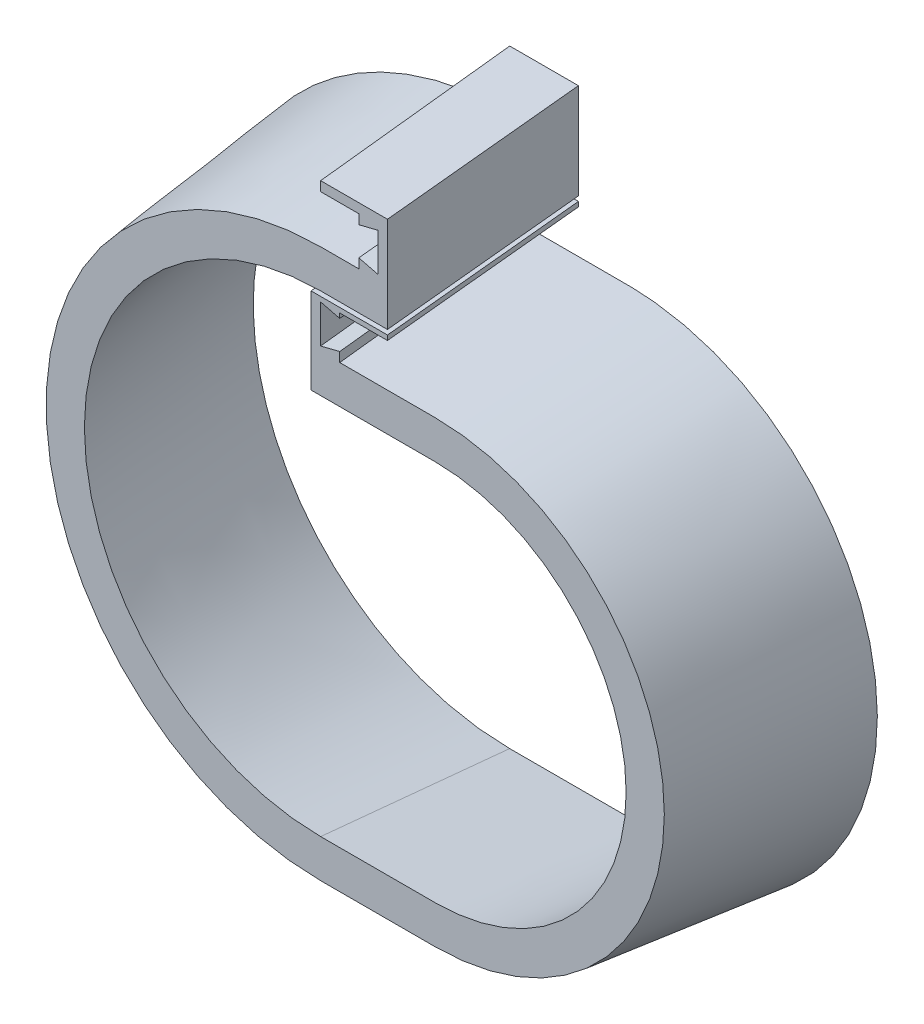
ISO-10303-21;
HEADER;
FILE_DESCRIPTION(('STEP AP214'),'2;1');
FILE_NAME('part.step','',(''),(''),'','','');
FILE_SCHEMA(('AUTOMOTIVE_DESIGN { 1 0 10303 214 1 1 1 1 }'));
ENDSEC;
DATA;
#1=APPLICATION_CONTEXT('core data for automotive mechanical design processes');
#2=APPLICATION_PROTOCOL_DEFINITION('international standard','automotive_design',2000,#1);
#3=PRODUCT_CONTEXT('',#1,'mechanical');
#4=PRODUCT('Part','Part','',(#3));
#5=PRODUCT_RELATED_PRODUCT_CATEGORY('part','',(#4));
#6=PRODUCT_DEFINITION_FORMATION('','',#4);
#7=PRODUCT_DEFINITION_CONTEXT('part definition',#1,'design');
#8=PRODUCT_DEFINITION('design','',#6,#7);
#9=PRODUCT_DEFINITION_SHAPE('','',#8);
#10=(LENGTH_UNIT() NAMED_UNIT(*) SI_UNIT(.MILLI.,.METRE.));
#11=(NAMED_UNIT(*) PLANE_ANGLE_UNIT() SI_UNIT($,.RADIAN.));
#12=(NAMED_UNIT(*) SI_UNIT($,.STERADIAN.) SOLID_ANGLE_UNIT());
#13=UNCERTAINTY_MEASURE_WITH_UNIT(LENGTH_MEASURE(1.E-05),#10,'distance_accuracy_value','');
#14=(GEOMETRIC_REPRESENTATION_CONTEXT(3) GLOBAL_UNCERTAINTY_ASSIGNED_CONTEXT((#13)) GLOBAL_UNIT_ASSIGNED_CONTEXT((#10,
#11,#12)) REPRESENTATION_CONTEXT('',''));
#15=CARTESIAN_POINT('',(0.,0.,0.));
#16=DIRECTION('',(0.,0.,1.));
#17=DIRECTION('',(1.,0.,0.));
#18=AXIS2_PLACEMENT_3D('',#15,#16,#17);
#19=CARTESIAN_POINT('',(0.,55.,-203.2));
#20=CARTESIAN_POINT('',(0.,33.5,0.));
#21=CARTESIAN_POINT('',(-0.666666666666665,55.,-203.2));
#22=CARTESIAN_POINT('',(-0.499999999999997,33.5,0.));
#23=CARTESIAN_POINT('',(-1.95853323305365,55.0000000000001,-203.2));
#24=CARTESIAN_POINT('',(-1.53224593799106,33.5,0.));
#25=CARTESIAN_POINT('',(-3.866435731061,54.9999999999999,-203.2));
#26=CARTESIAN_POINT('',(-3.10654982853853,33.4999999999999,0.));
#27=CARTESIAN_POINT('',(-5.82683340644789,55.,-203.2));
#28=CARTESIAN_POINT('',(-4.62208469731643,33.5000000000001,0.));
#29=CARTESIAN_POINT('',(-7.23468593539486,55.,-203.2));
#30=CARTESIAN_POINT('',(-5.5555684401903,33.5,0.));
#31=CARTESIAN_POINT('',(-11.2641929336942,55.,-203.2));
#32=CARTESIAN_POINT('',(-7.89557519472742,33.5,0.));
#33=CARTESIAN_POINT('',(-17.8045684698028,54.3619388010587,-203.2));
#34=CARTESIAN_POINT('',(-11.6794164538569,33.1237276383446,0.));
#35=CARTESIAN_POINT('',(-27.2723440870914,51.5071710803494,-203.200000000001));
#36=CARTESIAN_POINT('',(-17.1191804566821,31.4648699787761,0.));
#37=CARTESIAN_POINT('',(-36.0255986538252,46.8496743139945,-203.199999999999));
#38=CARTESIAN_POINT('',(-22.1146839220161,28.7805071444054,0.));
#39=CARTESIAN_POINT('',(-43.7171382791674,40.5582054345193,-203.200000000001));
#40=CARTESIAN_POINT('',(-26.4870256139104,25.1854971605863,0.));
#41=CARTESIAN_POINT('',(-50.0390461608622,32.8703201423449,-203.199999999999));
#42=CARTESIAN_POINT('',(-30.0636754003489,20.8105540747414,0.));
#43=CARTESIAN_POINT('',(-54.7369896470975,24.0824946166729,-203.200000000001));
#44=CARTESIAN_POINT('',(-32.7288159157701,15.8344322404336,0.));
#45=CARTESIAN_POINT('',(-57.6216558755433,14.5380344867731,-203.199999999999));
#46=CARTESIAN_POINT('',(-34.3666297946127,10.4358860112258,0.));
#47=CARTESIAN_POINT('',(-58.5775014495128,4.61225139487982,-203.200000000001));
#48=CARTESIAN_POINT('',(-34.9357954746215,4.82353372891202,0.));
#49=CARTESIAN_POINT('',(-57.5679117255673,-5.30374786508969,-203.199999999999));
#50=CARTESIAN_POINT('',(-34.3949913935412,-0.794006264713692,0.));
#51=CARTESIAN_POINT('',(-54.6367351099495,-14.8201211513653,-203.200000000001));
#52=CARTESIAN_POINT('',(-32.7819896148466,-6.20691884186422,0.));
#53=CARTESIAN_POINT('',(-49.9059421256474,-23.5652168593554,-203.2));
#54=CARTESIAN_POINT('',(-30.1345622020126,-11.2053888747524,0.));
#55=CARTESIAN_POINT('',(-43.5697389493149,-31.201421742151,-203.2));
#56=CARTESIAN_POINT('',(-26.5663084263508,-15.6074275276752,0.));
#57=CARTESIAN_POINT('',(-35.8852384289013,-37.4393924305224,-203.2));
#58=CARTESIAN_POINT('',(-22.190827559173,-19.2310459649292,0.));
#59=CARTESIAN_POINT('',(-27.1606532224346,-42.0494426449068,-203.199999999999));
#60=CARTESIAN_POINT('',(-17.1805874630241,-21.9411891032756,0.));
#61=CARTESIAN_POINT('',(-17.7408520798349,-44.870566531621,-203.2));
#62=CARTESIAN_POINT('',(-11.7149504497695,-23.6187749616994,0.));
#63=CARTESIAN_POINT('',(-11.2421188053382,-45.5,-203.2));
#64=CARTESIAN_POINT('',(-7.90800963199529,-24.,0.));
#65=CARTESIAN_POINT('',(-6.47972275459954,-45.5,-203.2));
#66=CARTESIAN_POINT('',(-5.10530618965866,-24.,0.));
#67=CARTESIAN_POINT('',(-3.79304055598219,-45.5000000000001,-203.2));
#68=CARTESIAN_POINT('',(-3.1708275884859,-24.,0.));
#69=CARTESIAN_POINT('',(-0.0588727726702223,-45.4999999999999,-203.2));
#70=CARTESIAN_POINT('',(0.0699625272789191,-24.,0.));
#71=CARTESIAN_POINT('',(3.69717185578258,-45.5000000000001,-203.2));
#72=CARTESIAN_POINT('',(3.26264972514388,-24.,0.));
#73=CARTESIAN_POINT('',(6.42696035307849,-45.5,-203.2));
#74=CARTESIAN_POINT('',(5.13502744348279,-24.,0.));
#75=CARTESIAN_POINT('',(10.9180414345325,-45.5,-203.2));
#76=CARTESIAN_POINT('',(7.60455317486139,-24.,0.));
#77=CARTESIAN_POINT('',(16.7760021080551,-44.9368462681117,-203.2));
#78=CARTESIAN_POINT('',(10.799526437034,-23.6764086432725,0.));
#79=CARTESIAN_POINT('',(25.292293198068,-42.3985100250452,-203.2));
#80=CARTESIAN_POINT('',(15.3716704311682,-22.266857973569,0.));
#81=CARTESIAN_POINT('',(33.2008254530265,-38.2342680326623,-203.2));
#82=CARTESIAN_POINT('',(19.5480206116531,-19.995392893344,0.));
#83=CARTESIAN_POINT('',(40.1807464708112,-32.5818434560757,-203.2));
#84=CARTESIAN_POINT('',(23.1883903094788,-16.9726862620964,0.));
#85=CARTESIAN_POINT('',(45.9427143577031,-25.6459332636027,-203.2));
#86=CARTESIAN_POINT('',(26.1525928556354,-13.3094109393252,0.));
#87=CARTESIAN_POINT('',(50.2439692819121,-17.6902756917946,-203.2));
#88=CARTESIAN_POINT('',(28.351308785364,-9.15600977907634,0.));
#89=CARTESIAN_POINT('',(52.9010287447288,-9.02651705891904,-203.199999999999));
#90=CARTESIAN_POINT('',(29.6952186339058,-4.66292563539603,0.));
#91=CARTESIAN_POINT('',(53.7996497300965,0.,-203.200000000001));
#92=CARTESIAN_POINT('',(30.1534720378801,0.,0.));
#93=CARTESIAN_POINT('',(52.9010287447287,9.02651705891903,-203.2));
#94=CARTESIAN_POINT('',(29.6952186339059,4.66292563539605,0.));
#95=CARTESIAN_POINT('',(50.2439692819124,17.6902756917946,-203.2));
#96=CARTESIAN_POINT('',(28.351308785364,9.15600977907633,0.));
#97=CARTESIAN_POINT('',(45.9427143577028,25.6459332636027,-203.2));
#98=CARTESIAN_POINT('',(26.1525928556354,13.3094109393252,0.));
#99=CARTESIAN_POINT('',(40.1807464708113,32.5818434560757,-203.2));
#100=CARTESIAN_POINT('',(23.1883903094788,16.9726862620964,0.));
#101=CARTESIAN_POINT('',(33.2008254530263,38.2342680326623,-203.2));
#102=CARTESIAN_POINT('',(19.5480206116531,19.995392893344,0.));
#103=CARTESIAN_POINT('',(25.292293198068,42.3985100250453,-203.2));
#104=CARTESIAN_POINT('',(15.3716704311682,22.266857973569,0.));
#105=CARTESIAN_POINT('',(16.776002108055,44.9368462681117,-203.2));
#106=CARTESIAN_POINT('',(10.799526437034,23.6764086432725,0.));
#107=CARTESIAN_POINT('',(10.9180414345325,45.5,-203.2));
#108=CARTESIAN_POINT('',(7.60455317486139,24.,0.));
#109=CARTESIAN_POINT('',(6.42696035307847,45.5,-203.2));
#110=CARTESIAN_POINT('',(5.13502744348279,24.,0.));
#111=CARTESIAN_POINT('',(3.59097487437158,45.5,-203.2));
#112=CARTESIAN_POINT('',(3.302436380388,24.,0.));
#113=CARTESIAN_POINT('',(-0.31357423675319,45.5,-203.2));
#114=CARTESIAN_POINT('',(0.269273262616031,24.,0.));
#115=CARTESIAN_POINT('',(-4.09728874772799,45.5,-203.2));
#116=CARTESIAN_POINT('',(-2.91882132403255,24.,0.));
#117=CARTESIAN_POINT('',(-6.66666666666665,45.5,-203.2));
#118=CARTESIAN_POINT('',(-5.,24.,0.));
#119=CARTESIAN_POINT('',(-8.,45.5,-203.2));
#120=CARTESIAN_POINT('',(-6.,24.,0.));
#121=B_SPLINE_SURFACE_WITH_KNOTS('',3,1,((#19,#20),(#21,#22),(#23,#24),(#25,#26),(#27,#28),(#29,
#30),(#31,#32),(#33,#34),(#35,#36),(#37,#38),(#39,#40),(#41,#42),(#43,#44),(#45,#46),(#47,#48),
(#49,#50),(#51,#52),(#53,#54),(#55,#56),(#57,#58),(#59,#60),(#61,#62),(#63,#64),(#65,#66),(#67,
#68),(#69,#70),(#71,#72),(#73,#74),(#75,#76),(#77,#78),(#79,#80),(#81,#82),(#83,#84),(#85,#86),
(#87,#88),(#89,#90),(#91,#92),(#93,#94),(#95,#96),(#97,#98),(#99,#100),(#101,#102),(#103,#104),
(#105,#106),(#107,#108),(#109,#110),(#111,#112),(#113,#114),(#115,#116),(#117,#118),(#119,
#120)),.UNSPECIFIED.,.F.,.F.,.F.,(4,1,1,1,2,1,1,1,1,1,1,1,1,1,1,1,1,1,1,1,2,1,1,1,2,1,1,1,1,1,1,
1,1,1,1,1,1,1,1,1,2,1,1,1,4),(2,2),(0.,0.00677489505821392,0.0135497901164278,
0.0203246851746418,0.0270995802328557,0.0559956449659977,0.0848917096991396,0.113787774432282,
0.142683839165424,0.171579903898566,0.200475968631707,0.22937203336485,0.258268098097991,
0.287164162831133,0.316060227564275,0.344956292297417,0.373852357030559,0.402748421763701,
0.431644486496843,0.460540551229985,0.489436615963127,0.502986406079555,0.516536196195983,
0.530085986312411,0.543635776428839,0.568771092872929,0.59390640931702,0.619041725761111,
0.644177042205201,0.669312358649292,0.694447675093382,0.719582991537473,0.744718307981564,
0.769853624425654,0.794988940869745,0.820124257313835,0.845259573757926,0.870394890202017,
0.895530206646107,0.920665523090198,0.945800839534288,0.959350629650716,0.972900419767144,
0.986450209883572,1.),(0.,1.),.UNSPECIFIED.);
#122=DIRECTION('',(0.,-0.10521975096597,0.994448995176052));
#123=VECTOR('',#122,1.);
#124=CARTESIAN_POINT('',(-2.,55.,-203.2));
#125=LINE('',#124,#123);
#126=CARTESIAN_POINT('',(-2.,35.6161417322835,-20.));
#127=VERTEX_POINT('',#126);
#128=CARTESIAN_POINT('',(-2.,33.5,0.));
#129=VERTEX_POINT('',#128);
#130=EDGE_CURVE('E695',#127,#129,#125,.T.);
#131=CARTESIAN_POINT('',(-0.326274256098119,35.6161417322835,-20.));
#132=CARTESIAN_POINT('',(-0.766421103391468,35.6161417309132,-20.));
#133=CARTESIAN_POINT('',(-1.20656795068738,35.6161417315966,-20.));
#134=CARTESIAN_POINT('',(-2.08914684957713,35.616141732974,-20.));
#135=CARTESIAN_POINT('',(-2.53157890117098,35.616141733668,-20.));
#136=CARTESIAN_POINT('',(-3.19598944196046,35.6161417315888,-20.));
#137=CARTESIAN_POINT('',(-3.41796793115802,35.6161417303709,-20.));
#138=CARTESIAN_POINT('',(-3.86192270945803,35.616141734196,-20.));
#139=CARTESIAN_POINT('',(-4.08389899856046,35.616141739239,-20.));
#140=CARTESIAN_POINT('',(-4.4170520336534,35.6161417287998,-20.));
#141=CARTESIAN_POINT('',(-4.52822877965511,35.6161417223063,-20.));
#142=CARTESIAN_POINT('',(-4.75058224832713,35.6161417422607,-20.));
#143=CARTESIAN_POINT('',(-4.86175897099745,35.6161417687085,-20.));
#144=CARTESIAN_POINT('',(-5.08411642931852,35.6161416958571,-20.));
#145=CARTESIAN_POINT('',(-5.19529716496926,35.6161415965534,-20.));
#146=CARTESIAN_POINT('',(-5.41765872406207,35.6161418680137,-20.));
#147=CARTESIAN_POINT('',(-5.52883954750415,35.6161422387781,-20.));
#148=CARTESIAN_POINT('',(-5.69561424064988,35.6161414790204,-20.));
#149=CARTESIAN_POINT('',(-5.75120811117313,35.6161410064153,-20.));
#150=CARTESIAN_POINT('',(-5.86239591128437,35.6161424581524,-20.));
#151=CARTESIAN_POINT('',(-5.91798984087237,35.6161443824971,-20.));
#152=CARTESIAN_POINT('',(-6.02917763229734,35.6161390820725,-20.));
#153=CARTESIAN_POINT('',(-6.08477149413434,35.6161318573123,-20.));
#154=CARTESIAN_POINT('',(-6.16816226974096,35.6161466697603,-20.));
#155=CARTESIAN_POINT('',(-6.19595916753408,35.6161558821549,-20.));
#156=CARTESIAN_POINT('',(-6.25155287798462,35.6161040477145,-20.));
#157=CARTESIAN_POINT('',(-6.2793496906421,35.6160430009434,-20.));
#158=CARTESIAN_POINT('',(-6.41832548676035,35.6155480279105,-20.));
#159=CARTESIAN_POINT('',(-6.52950308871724,35.6145448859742,-20.));
#160=CARTESIAN_POINT('',(-6.75184023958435,35.6113371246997,-20.));
#161=CARTESIAN_POINT('',(-6.86299978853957,35.6091325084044,-20.));
#162=CARTESIAN_POINT('',(-7.0859567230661,35.6035031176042,-20.));
#163=CARTESIAN_POINT('',(-7.19775392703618,35.6000710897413,-20.));
#164=CARTESIAN_POINT('',(-7.4213045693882,35.591991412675,-20.));
#165=CARTESIAN_POINT('',(-7.5330580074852,35.587343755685,-20.));
#166=CARTESIAN_POINT('',(-7.86825073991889,35.5715781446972,-20.));
#167=CARTESIAN_POINT('',(-8.09160718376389,35.5586379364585,-20.));
#168=CARTESIAN_POINT('',(-8.53748064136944,35.5279445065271,-20.));
#169=CARTESIAN_POINT('',(-8.75999841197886,35.5102022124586,-20.));
#170=CARTESIAN_POINT('',(-9.2045897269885,35.4699034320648,-20.));
#171=CARTESIAN_POINT('',(-9.42666328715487,35.4473471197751,-20.));
#172=CARTESIAN_POINT('',(-9.86993798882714,35.3974682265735,-20.));
#173=CARTESIAN_POINT('',(-10.0911399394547,35.3701528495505,-20.));
#174=CARTESIAN_POINT('',(-10.5329002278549,35.3107446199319,-20.));
#175=CARTESIAN_POINT('',(-10.7534585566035,35.2786517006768,-20.));
#176=CARTESIAN_POINT('',(-11.4136535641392,35.175278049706,-20.));
#177=CARTESIAN_POINT('',(-11.8521968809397,35.0968589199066,-20.));
#178=CARTESIAN_POINT('',(-12.7254020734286,34.9210934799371,-20.));
#179=CARTESIAN_POINT('',(-13.1600643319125,34.8237490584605,-20.));
#180=CARTESIAN_POINT('',(-14.1547342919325,34.5782817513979,-20.));
#181=CARTESIAN_POINT('',(-14.7131595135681,34.4236900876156,-20.));
#182=CARTESIAN_POINT('',(-15.8210768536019,34.0831824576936,-20.));
#183=CARTESIAN_POINT('',(-16.3705577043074,33.8972298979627,-20.));
#184=CARTESIAN_POINT('',(-17.4583134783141,33.4945414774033,-20.));
#185=CARTESIAN_POINT('',(-17.9965850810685,33.2777966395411,-20.));
#186=CARTESIAN_POINT('',(-19.0583657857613,32.8149067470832,-20.));
#187=CARTESIAN_POINT('',(-19.5819150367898,32.568853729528,-20.));
#188=CARTESIAN_POINT('',(-20.6141658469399,32.0478882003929,-20.));
#189=CARTESIAN_POINT('',(-21.1228740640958,31.7729888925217,-20.));
#190=CARTESIAN_POINT('',(-22.1240176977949,31.1952164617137,-20.));
#191=CARTESIAN_POINT('',(-22.6164547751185,30.8923462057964,-20.));
#192=CARTESIAN_POINT('',(-23.8261220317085,30.1007480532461,-20.));
#193=CARTESIAN_POINT('',(-24.5323275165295,29.5949454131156,-20.));
#194=CARTESIAN_POINT('',(-25.5576638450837,28.7932353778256,-20.));
#195=CARTESIAN_POINT('',(-25.8938341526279,28.5187813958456,-20.));
#196=CARTESIAN_POINT('',(-26.5543238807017,27.9559221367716,-20.));
#197=CARTESIAN_POINT('',(-26.8786435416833,27.6675171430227,-20.));
#198=CARTESIAN_POINT('',(-27.5151729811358,27.076854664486,-20.));
#199=CARTESIAN_POINT('',(-27.8273667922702,26.7745799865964,-20.));
#200=CARTESIAN_POINT('',(-28.438589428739,26.156997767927,-20.));
#201=CARTESIAN_POINT('',(-28.7376181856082,25.8416901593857,-20.));
#202=CARTESIAN_POINT('',(-29.3220734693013,25.1986803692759,-20.));
#203=CARTESIAN_POINT('',(-29.6074994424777,24.8709776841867,-20.));
#204=CARTESIAN_POINT('',(-30.1642675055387,24.2038559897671,-20.));
#205=CARTESIAN_POINT('',(-30.4356095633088,23.8644369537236,-20.));
#206=CARTESIAN_POINT('',(-31.2266481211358,22.8311019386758,-20.));
#207=CARTESIAN_POINT('',(-31.7248169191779,22.1205002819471,-20.));
#208=CARTESIAN_POINT('',(-32.659730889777,20.6603713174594,-20.));
#209=CARTESIAN_POINT('',(-33.0964917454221,19.9108540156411,-20.));
#210=CARTESIAN_POINT('',(-33.905223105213,18.3783862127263,-20.));
#211=CARTESIAN_POINT('',(-34.2772473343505,17.5954641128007,-20.));
#212=CARTESIAN_POINT('',(-34.9537761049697,16.0000507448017,-20.));
#213=CARTESIAN_POINT('',(-35.2582133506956,15.1875309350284,-20.));
#214=CARTESIAN_POINT('',(-35.797791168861,13.5391856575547,-20.));
#215=CARTESIAN_POINT('',(-36.0328801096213,12.703343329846,-20.));
#216=CARTESIAN_POINT('',(-36.4322026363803,11.0147850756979,-20.));
#217=CARTESIAN_POINT('',(-36.5964362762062,10.1620691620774,-20.));
#218=CARTESIAN_POINT('',(-36.788736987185,8.87501855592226,-20.));
#219=CARTESIAN_POINT('',(-36.843836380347,8.44455686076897,-20.));
#220=CARTESIAN_POINT('',(-36.9358723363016,7.58176671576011,-20.));
#221=CARTESIAN_POINT('',(-36.9728130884,7.14943871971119,-20.));
#222=CARTESIAN_POINT('',(-37.0284010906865,6.28376693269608,-20.));
#223=CARTESIAN_POINT('',(-37.0470547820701,5.85042355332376,-20.));
#224=CARTESIAN_POINT('',(-37.0659298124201,4.98334784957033,-20.));
#225=CARTESIAN_POINT('',(-37.0661517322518,4.54961553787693,-20.));
#226=CARTESIAN_POINT('',(-37.0481551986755,3.68178006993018,-20.));
#227=CARTESIAN_POINT('',(-37.0299049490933,3.24767756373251,-20.));
#228=CARTESIAN_POINT('',(-36.9750858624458,2.38072662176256,-20.));
#229=CARTESIAN_POINT('',(-36.9385198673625,1.94787800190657,-20.));
#230=CARTESIAN_POINT('',(-36.8016109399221,0.652973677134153,-20.));
#231=CARTESIAN_POINT('',(-36.6740376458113,-0.206352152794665,-20.));
#232=CARTESIAN_POINT('',(-36.3472475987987,-1.91153402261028,-20.));
#233=CARTESIAN_POINT('',(-36.1480097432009,-2.75738601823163,-20.));
#234=CARTESIAN_POINT('',(-35.7964363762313,-4.01125098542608,-20.));
#235=CARTESIAN_POINT('',(-35.6704292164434,-4.42680064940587,-20.));
#236=CARTESIAN_POINT('',(-35.4009796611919,-5.25223657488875,-20.));
#237=CARTESIAN_POINT('',(-35.2575373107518,-5.66212285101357,-20.));
#238=CARTESIAN_POINT('',(-34.9532563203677,-6.4757526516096,-20.));
#239=CARTESIAN_POINT('',(-34.7924039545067,-6.87949103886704,-20.));
#240=CARTESIAN_POINT('',(-34.4536252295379,-7.67973949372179,-20.));
#241=CARTESIAN_POINT('',(-34.2756988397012,-8.07624954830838,-20.));
#242=CARTESIAN_POINT('',(-33.9032174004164,-8.86138666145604,-20.));
#243=CARTESIAN_POINT('',(-33.7086623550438,-9.25001372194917,-20.));
#244=CARTESIAN_POINT('',(-33.3033593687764,-10.0186968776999,-20.));
#245=CARTESIAN_POINT('',(-33.0926113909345,-10.3987529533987,-20.));
#246=CARTESIAN_POINT('',(-32.4366826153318,-11.5251010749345,-20.));
#247=CARTESIAN_POINT('',(-31.967735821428,-12.257743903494,-20.));
#248=CARTESIAN_POINT('',(-30.9701145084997,-13.6809727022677,-20.));
#249=CARTESIAN_POINT('',(-30.4414425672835,-14.3715604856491,-20.));
#250=CARTESIAN_POINT('',(-29.3283758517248,-15.7051033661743,-20.));
#251=CARTESIAN_POINT('',(-28.7440402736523,-16.3481078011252,-20.));
#252=CARTESIAN_POINT('',(-27.5227343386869,-17.5821279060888,-20.));
#253=CARTESIAN_POINT('',(-26.8857594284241,-18.1731390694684,-20.));
#254=CARTESIAN_POINT('',(-25.5639277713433,-19.2997018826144,-20.));
#255=CARTESIAN_POINT('',(-24.8790433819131,-19.8352210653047,-20.));
#256=CARTESIAN_POINT('',(-23.4667559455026,-20.8466391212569,-20.));
#257=CARTESIAN_POINT('',(-22.7393639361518,-21.3225533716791,-20.));
#258=CARTESIAN_POINT('',(-21.4963219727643,-22.0631294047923,-20.));
#259=CARTESIAN_POINT('',(-20.9910032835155,-22.3452941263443,-20.));
#260=CARTESIAN_POINT('',(-19.9652059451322,-22.880926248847,-20.));
#261=CARTESIAN_POINT('',(-19.4447242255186,-23.1343877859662,-20.));
#262=CARTESIAN_POINT('',(-18.3898758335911,-23.6117487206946,-20.));
#263=CARTESIAN_POINT('',(-17.8554982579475,-23.8356240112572,-20.));
#264=CARTESIAN_POINT('',(-16.7766409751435,-24.2521961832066,-20.));
#265=CARTESIAN_POINT('',(-16.2321980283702,-24.4449882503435,-20.));
#266=CARTESIAN_POINT('',(-15.1336562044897,-24.7996810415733,-20.));
#267=CARTESIAN_POINT('',(-14.5795623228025,-24.9615972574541,-20.));
#268=CARTESIAN_POINT('',(-13.4642262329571,-25.2538717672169,-20.));
#269=CARTESIAN_POINT('',(-12.9030000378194,-25.3842908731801,-20.));
#270=CARTESIAN_POINT('',(-12.0736243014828,-25.5526671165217,-20.));
#271=CARTESIAN_POINT('',(-11.8079273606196,-25.6029739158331,-20.));
#272=CARTESIAN_POINT('',(-11.2753022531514,-25.6965853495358,-20.));
#273=CARTESIAN_POINT('',(-11.0083741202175,-25.7398901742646,-20.));
#274=CARTESIAN_POINT('',(-10.4734060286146,-25.8194874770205,-20.));
#275=CARTESIAN_POINT('',(-10.2053658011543,-25.855778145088,-20.));
#276=CARTESIAN_POINT('',(-9.66840900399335,-25.9213154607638,-20.));
#277=CARTESIAN_POINT('',(-9.39949238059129,-25.950561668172,-20.));
#278=CARTESIAN_POINT('',(-8.86061246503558,-26.0020225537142,-20.));
#279=CARTESIAN_POINT('',(-8.59064824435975,-26.0242275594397,-20.));
#280=CARTESIAN_POINT('',(-8.18536054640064,-26.0522037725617,-20.));
#281=CARTESIAN_POINT('',(-8.05021598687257,-26.0606402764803,-20.));
#282=CARTESIAN_POINT('',(-7.77982476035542,-26.0757351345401,-20.));
#283=CARTESIAN_POINT('',(-7.64457809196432,-26.0823934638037,-20.));
#284=CARTESIAN_POINT('',(-7.3736925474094,-26.0939423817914,-20.));
#285=CARTESIAN_POINT('',(-7.23805349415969,-26.0988287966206,-20.));
#286=CARTESIAN_POINT('',(-6.96672660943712,-26.1068111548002,-20.));
#287=CARTESIAN_POINT('',(-6.83103877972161,-26.1099071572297,-20.));
#288=CARTESIAN_POINT('',(-6.62747735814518,-26.11320234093,-20.));
#289=CARTESIAN_POINT('',(-6.55961398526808,-26.1140759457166,-20.));
#290=CARTESIAN_POINT('',(-6.42388274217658,-26.1153807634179,-20.));
#291=CARTESIAN_POINT('',(-6.35601487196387,-26.1158119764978,-20.));
#292=CARTESIAN_POINT('',(-6.22027633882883,-26.1162005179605,-20.));
#293=CARTESIAN_POINT('',(-6.15240567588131,-26.1161578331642,-20.));
#294=CARTESIAN_POINT('',(-6.01666441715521,-26.116125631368,-20.));
#295=CARTESIAN_POINT('',(-5.94879382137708,-26.1161361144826,-20.));
#296=CARTESIAN_POINT('',(-5.74518869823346,-26.1161529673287,-20.));
#297=CARTESIAN_POINT('',(-5.60945411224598,-26.1161447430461,-20.));
#298=CARTESIAN_POINT('',(-5.33798510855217,-26.1161387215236,-20.));
#299=CARTESIAN_POINT('',(-5.2022506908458,-26.1161409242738,-20.));
#300=CARTESIAN_POINT('',(-4.93079038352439,-26.1161425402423,-20.));
#301=CARTESIAN_POINT('',(-4.79506449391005,-26.1161419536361,-20.));
#302=CARTESIAN_POINT('',(-4.52361268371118,-26.1161415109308,-20.));
#303=CARTESIAN_POINT('',(-4.38788676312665,-26.116141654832,-20.));
#304=CARTESIAN_POINT('',(-3.97816081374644,-26.1161418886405,-20.));
#305=CARTESIAN_POINT('',(-3.70416078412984,-26.1161417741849,-20.));
#306=CARTESIAN_POINT('',(-3.15615606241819,-26.1161416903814,-20.));
#307=CARTESIAN_POINT('',(-2.88215137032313,-26.116141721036,-20.));
#308=CARTESIAN_POINT('',(-2.33453511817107,-26.1161417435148,-20.));
#309=CARTESIAN_POINT('',(-2.06092355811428,-26.1161417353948,-20.));
#310=CARTESIAN_POINT('',(-1.51370169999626,-26.1161417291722,-20.));
#311=CARTESIAN_POINT('',(-1.24009140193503,-26.1161417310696,-20.));
#312=CARTESIAN_POINT('',(-0.419628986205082,-26.1161417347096,-20.));
#313=CARTESIAN_POINT('',(0.127223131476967,-26.1161417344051,-20.));
#314=CARTESIAN_POINT('',(1.22097074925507,-26.1161417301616,-20.));
#315=CARTESIAN_POINT('',(1.76786624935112,-26.1161417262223,-20.));
#316=CARTESIAN_POINT('',(2.58843731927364,-26.1161417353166,-20.));
#317=CARTESIAN_POINT('',(2.86211288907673,-26.116141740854,-20.));
#318=CARTESIAN_POINT('',(3.40946489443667,-26.116141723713,-20.));
#319=CARTESIAN_POINT('',(3.68314132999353,-26.1161417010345,-20.));
#320=CARTESIAN_POINT('',(4.12724005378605,-26.1161417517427,-20.));
#321=CARTESIAN_POINT('',(4.29766234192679,-26.1161417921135,-20.));
#322=CARTESIAN_POINT('',(4.63850522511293,-26.116141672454,-20.));
#323=CARTESIAN_POINT('',(4.80892582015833,-26.1161415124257,-20.));
#324=CARTESIAN_POINT('',(5.14981303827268,-26.1161419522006,-20.));
#325=CARTESIAN_POINT('',(5.32027966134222,-26.1161425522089,-20.));
#326=CARTESIAN_POINT('',(5.57598254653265,-26.1161413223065,-20.));
#327=CARTESIAN_POINT('',(5.66121881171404,-26.1161405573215,-20.));
#328=CARTESIAN_POINT('',(5.83169140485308,-26.1161429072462,-20.));
#329=CARTESIAN_POINT('',(5.91692773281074,-26.1161460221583,-20.));
#330=CARTESIAN_POINT('',(6.04475804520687,-26.1161395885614,-20.));
#331=CARTESIAN_POINT('',(6.08735204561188,-26.1161355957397,-20.));
#332=CARTESIAN_POINT('',(6.17254004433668,-26.1161478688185,-20.));
#333=CARTESIAN_POINT('',(6.2151340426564,-26.1161641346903,-20.));
#334=CARTESIAN_POINT('',(6.3429140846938,-26.1158829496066,-20.));
#335=CARTESIAN_POINT('',(6.4280997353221,-26.115255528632,-20.));
#336=CARTESIAN_POINT('',(6.59845453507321,-26.1131750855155,-20.));
#337=CARTESIAN_POINT('',(6.68362368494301,-26.1117221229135,-20.));
#338=CARTESIAN_POINT('',(6.85394491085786,-26.1079773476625,-20.));
#339=CARTESIAN_POINT('',(6.93909698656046,-26.1056855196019,-20.));
#340=CARTESIAN_POINT('',(7.1943600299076,-26.0975632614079,-20.));
#341=CARTESIAN_POINT('',(7.36443298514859,-26.0904841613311,-20.));
#342=CARTESIAN_POINT('',(7.70441935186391,-26.0729987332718,-20.));
#343=CARTESIAN_POINT('',(7.87433275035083,-26.0625921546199,-20.));
#344=CARTESIAN_POINT('',(8.2139214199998,-26.0384608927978,-20.));
#345=CARTESIAN_POINT('',(8.38359669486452,-26.0247362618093,-20.));
#346=CARTESIAN_POINT('',(8.72264086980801,-25.9939774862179,-20.));
#347=CARTESIAN_POINT('',(8.89200978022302,-25.9769434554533,-20.));
#348=CARTESIAN_POINT('',(9.22822541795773,-25.9398123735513,-20.));
#349=CARTESIAN_POINT('',(9.39507675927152,-25.9197571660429,-20.));
#350=CARTESIAN_POINT('',(9.72836196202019,-25.8764375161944,-20.));
#351=CARTESIAN_POINT('',(9.89479581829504,-25.8531730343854,-20.));
#352=CARTESIAN_POINT('',(10.3938265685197,-25.7785115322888,-20.));
#353=CARTESIAN_POINT('',(10.7257161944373,-25.7222946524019,-20.));
#354=CARTESIAN_POINT('',(11.3873593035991,-25.5970340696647,-20.));
#355=CARTESIAN_POINT('',(11.7171106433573,-25.5279790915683,-20.));
#356=CARTESIAN_POINT('',(12.373841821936,-25.3771508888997,-20.));
#357=CARTESIAN_POINT('',(12.7008204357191,-25.2953723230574,-20.));
#358=CARTESIAN_POINT('',(13.3513563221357,-25.119250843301,-20.));
#359=CARTESIAN_POINT('',(13.6749137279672,-25.024908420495,-20.));
#360=CARTESIAN_POINT('',(14.4047251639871,-24.7967038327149,-20.));
#361=CARTESIAN_POINT('',(14.8097967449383,-24.6590394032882,-20.));
#362=CARTESIAN_POINT('',(15.6124111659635,-24.3640070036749,-20.));
#363=CARTESIAN_POINT('',(16.0099584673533,-24.2066511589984,-20.));
#364=CARTESIAN_POINT('',(16.7966610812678,-23.872500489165,-20.));
#365=CARTESIAN_POINT('',(17.1858188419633,-23.6957114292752,-20.));
#366=CARTESIAN_POINT('',(17.9549771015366,-23.3232215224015,-20.));
#367=CARTESIAN_POINT('',(18.3349774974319,-23.1275204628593,-20.));
#368=CARTESIAN_POINT('',(19.0884469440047,-22.7158418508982,-20.));
#369=CARTESIAN_POINT('',(19.4618218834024,-22.4996920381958,-20.));
#370=CARTESIAN_POINT('',(20.1975481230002,-22.0492017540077,-20.));
#371=CARTESIAN_POINT('',(20.5598968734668,-21.81485711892,-20.));
#372=CARTESIAN_POINT('',(21.2726201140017,-21.3285803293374,-20.));
#373=CARTESIAN_POINT('',(21.6229940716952,-21.0766473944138,-20.));
#374=CARTESIAN_POINT('',(22.3108381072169,-20.5558467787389,-20.));
#375=CARTESIAN_POINT('',(22.6483099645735,-20.2869814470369,-20.));
#376=CARTESIAN_POINT('',(23.3551268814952,-19.6946986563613,-20.));
#377=CARTESIAN_POINT('',(23.722455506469,-19.3688694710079,-20.));
#378=CARTESIAN_POINT('',(24.4379665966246,-18.6969884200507,-20.));
#379=CARTESIAN_POINT('',(24.7861533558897,-18.3509411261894,-20.));
#380=CARTESIAN_POINT('',(25.4622756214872,-17.6396407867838,-20.));
#381=CARTESIAN_POINT('',(25.7902124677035,-17.274389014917,-20.));
#382=CARTESIAN_POINT('',(26.4237365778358,-16.5274684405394,-20.));
#383=CARTESIAN_POINT('',(26.7294066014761,-16.1458697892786,-20.));
#384=CARTESIAN_POINT('',(27.3189578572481,-15.3661330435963,-20.));
#385=CARTESIAN_POINT('',(27.6028372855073,-14.9679935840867,-20.));
#386=CARTESIAN_POINT('',(28.1478990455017,-14.1565015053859,-20.));
#387=CARTESIAN_POINT('',(28.4090805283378,-13.7431483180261,-20.));
#388=CARTESIAN_POINT('',(29.0327437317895,-12.6921391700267,-20.));
#389=CARTESIAN_POINT('',(29.3805795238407,-12.0456709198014,-20.));
#390=CARTESIAN_POINT('',(29.8604663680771,-11.0559704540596,-20.));
#391=CARTESIAN_POINT('',(30.0134617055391,-10.7227090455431,-20.));
#392=CARTESIAN_POINT('',(30.3051737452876,-10.0499945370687,-20.));
#393=CARTESIAN_POINT('',(30.4438907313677,-9.71054156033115,-20.));
#394=CARTESIAN_POINT('',(30.8385473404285,-8.68305843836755,-20.));
#395=CARTESIAN_POINT('',(31.0726939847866,-7.98652001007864,-20.));
#396=CARTESIAN_POINT('',(31.4816438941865,-6.57628438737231,-20.));
#397=CARTESIAN_POINT('',(31.6564429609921,-5.86258598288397,-20.));
#398=CARTESIAN_POINT('',(31.9455351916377,-4.42333628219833,-20.));
#399=CARTESIAN_POINT('',(32.0598525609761,-3.69778984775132,-20.));
#400=CARTESIAN_POINT('',(32.2271788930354,-2.23961043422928,-20.));
#401=CARTESIAN_POINT('',(32.2801919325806,-1.50697792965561,-20.));
#402=CARTESIAN_POINT('',(32.3130437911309,-0.406878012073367,-20.));
#403=CARTESIAN_POINT('',(32.3162160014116,-0.0399778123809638,-20.));
#404=CARTESIAN_POINT('',(32.3069602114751,0.693625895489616,-20.));
#405=CARTESIAN_POINT('',(32.2945321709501,1.06032940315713,-20.));
#406=CARTESIAN_POINT('',(32.234030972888,2.15916426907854,-20.));
#407=CARTESIAN_POINT('',(32.1627445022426,2.89014823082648,-20.));
#408=CARTESIAN_POINT('',(31.9591358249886,4.34350179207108,-20.));
#409=CARTESIAN_POINT('',(31.8268103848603,5.06587093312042,-20.));
#410=CARTESIAN_POINT('',(31.5020926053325,6.49698429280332,-20.));
#411=CARTESIAN_POINT('',(31.3097020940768,7.20572892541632,-20.));
#412=CARTESIAN_POINT('',(30.8660531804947,8.60429636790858,-20.));
#413=CARTESIAN_POINT('',(30.6148147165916,9.29412549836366,-20.));
#414=CARTESIAN_POINT('',(30.054643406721,10.6499490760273,-20.));
#415=CARTESIAN_POINT('',(29.7457103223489,11.3159434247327,-20.));
#416=CARTESIAN_POINT('',(29.0730133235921,12.619531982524,-20.));
#417=CARTESIAN_POINT('',(28.7092555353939,13.2571293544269,-20.));
#418=CARTESIAN_POINT('',(27.929629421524,14.4996120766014,-20.));
#419=CARTESIAN_POINT('',(27.5137600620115,15.1044967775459,-20.));
#420=CARTESIAN_POINT('',(26.6320517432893,16.2782076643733,-20.));
#421=CARTESIAN_POINT('',(26.1661403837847,16.8469796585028,-20.));
#422=CARTESIAN_POINT('',(25.4326141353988,17.6689572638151,-20.));
#423=CARTESIAN_POINT('',(25.1822982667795,17.9377820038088,-20.));
#424=CARTESIAN_POINT('',(24.6704492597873,18.4645223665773,-20.));
#425=CARTESIAN_POINT('',(24.4089168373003,18.7224386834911,-20.));
#426=CARTESIAN_POINT('',(23.7855228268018,19.3116507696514,-20.));
#427=CARTESIAN_POINT('',(23.4194561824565,19.6385113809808,-20.));
#428=CARTESIAN_POINT('',(22.6695170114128,20.2711259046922,-20.));
#429=CARTESIAN_POINT('',(22.2856438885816,20.5768791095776,-20.));
#430=CARTESIAN_POINT('',(21.5013632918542,21.1663785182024,-20.));
#431=CARTESIAN_POINT('',(21.1009560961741,21.4501250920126,-20.));
#432=CARTESIAN_POINT('',(20.2865419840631,21.9936168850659,-20.));
#433=CARTESIAN_POINT('',(19.8725975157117,22.2534556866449,-20.));
#434=CARTESIAN_POINT('',(19.0308494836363,22.7496061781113,-20.));
#435=CARTESIAN_POINT('',(18.6030460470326,22.9859180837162,-20.));
#436=CARTESIAN_POINT('',(17.7348218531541,23.4342218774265,-20.));
#437=CARTESIAN_POINT('',(17.2944001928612,23.6462120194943,-20.));
#438=CARTESIAN_POINT('',(16.513977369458,23.9950744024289,-20.));
#439=CARTESIAN_POINT('',(16.1764315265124,24.1374679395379,-20.));
#440=CARTESIAN_POINT('',(15.4955981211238,24.4078288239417,-20.));
#441=CARTESIAN_POINT('',(15.1523104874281,24.5357959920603,-20.));
#442=CARTESIAN_POINT('',(14.4606709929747,24.7771478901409,-20.));
#443=CARTESIAN_POINT('',(14.1123194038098,24.8905333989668,-20.));
#444=CARTESIAN_POINT('',(13.4112066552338,25.102550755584,-20.));
#445=CARTESIAN_POINT('',(13.0584461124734,25.2011846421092,-20.));
#446=CARTESIAN_POINT('',(12.3459743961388,25.3843640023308,-20.));
#447=CARTESIAN_POINT('',(11.9862293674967,25.4687777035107,-20.));
#448=CARTESIAN_POINT('',(11.2634816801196,25.6222802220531,-20.));
#449=CARTESIAN_POINT('',(10.9004791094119,25.6913694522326,-20.));
#450=CARTESIAN_POINT('',(10.3540785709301,25.7834195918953,-20.));
#451=CARTESIAN_POINT('',(10.1716378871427,25.8121712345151,-20.));
#452=CARTESIAN_POINT('',(9.8061890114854,25.865807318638,-20.));
#453=CARTESIAN_POINT('',(9.62318082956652,25.8906918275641,-20.));
#454=CARTESIAN_POINT('',(9.25673758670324,25.936574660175,-20.));
#455=CARTESIAN_POINT('',(9.07330267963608,25.9575742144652,-20.));
#456=CARTESIAN_POINT('',(8.70602111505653,25.9956870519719,-20.));
#457=CARTESIAN_POINT('',(8.52217443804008,26.0128001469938,-20.));
#458=CARTESIAN_POINT('',(8.13897911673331,26.0443789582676,-20.));
#459=CARTESIAN_POINT('',(7.93960264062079,26.0585098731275,-20.));
#460=CARTESIAN_POINT('',(7.6403487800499,26.0762693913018,-20.));
#461=CARTESIAN_POINT('',(7.54057036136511,26.0816162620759,-20.));
#462=CARTESIAN_POINT('',(7.34095716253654,26.0911635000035,-20.));
#463=CARTESIAN_POINT('',(7.2411223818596,26.095363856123,-20.));
#464=CARTESIAN_POINT('',(7.04139438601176,26.1026164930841,-20.));
#465=CARTESIAN_POINT('',(6.94150116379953,26.1056685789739,-20.));
#466=CARTESIAN_POINT('',(6.74168827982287,26.1106238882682,-20.));
#467=CARTESIAN_POINT('',(6.64176861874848,26.1125271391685,-20.));
#468=CARTESIAN_POINT('',(6.49187334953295,26.1145143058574,-20.));
#469=CARTESIAN_POINT('',(6.44190309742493,26.1150320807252,-20.));
#470=CARTESIAN_POINT('',(6.34196026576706,26.1157867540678,-20.));
#471=CARTESIAN_POINT('',(6.29198768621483,26.1160236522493,-20.));
#472=CARTESIAN_POINT('',(6.21702809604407,26.1161418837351,-20.));
#473=CARTESIAN_POINT('',(6.19204120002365,26.1161417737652,-20.));
#474=CARTESIAN_POINT('',(6.14206740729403,26.1161416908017,-20.));
#475=CARTESIAN_POINT('',(6.11708051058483,26.1161417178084,-20.));
#476=CARTESIAN_POINT('',(6.04211981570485,26.1161417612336,-20.));
#477=CARTESIAN_POINT('',(5.99214601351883,26.1161417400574,-20.));
#478=CARTESIAN_POINT('',(5.89214878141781,26.1161417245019,-20.));
#479=CARTESIAN_POINT('',(5.84212535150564,26.1161417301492,-20.));
#480=CARTESIAN_POINT('',(5.74207849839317,26.1161417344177,-20.));
#481=CARTESIAN_POINT('',(5.69205507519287,26.1161417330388,-20.));
#482=CARTESIAN_POINT('',(5.54198581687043,26.1161417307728,-20.));
#483=CARTESIAN_POINT('',(5.44193998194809,26.1161417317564,-20.));
#484=CARTESIAN_POINT('',(5.14181107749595,26.1161417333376,-20.));
#485=CARTESIAN_POINT('',(4.94172800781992,26.116141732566,-20.));
#486=CARTESIAN_POINT('',(4.54140683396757,26.1161417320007,-20.));
#487=CARTESIAN_POINT('',(4.34116872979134,26.1161417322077,-20.));
#488=CARTESIAN_POINT('',(3.94068994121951,26.1161417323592,-20.));
#489=CARTESIAN_POINT('',(3.74044925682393,26.1161417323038,-20.));
#490=CARTESIAN_POINT('',(3.33986957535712,26.1161417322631,-20.));
#491=CARTESIAN_POINT('',(3.13953057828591,26.1161417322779,-20.));
#492=CARTESIAN_POINT('',(2.73885327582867,26.116141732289,-20.));
#493=CARTESIAN_POINT('',(2.53851497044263,26.1161417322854,-20.));
#494=CARTESIAN_POINT('',(1.93740536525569,26.1161417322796,-20.));
#495=CARTESIAN_POINT('',(1.53663406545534,26.1161417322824,-20.));
#496=CARTESIAN_POINT('',(0.745419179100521,26.1161417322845,-20.));
#497=CARTESIAN_POINT('',(0.354975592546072,26.1161417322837,-20.));
#498=CARTESIAN_POINT('',(-0.425785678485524,26.1161417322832,-20.));
#499=CARTESIAN_POINT('',(-0.81610336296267,26.1161417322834,-20.));
#500=CARTESIAN_POINT('',(-1.59648877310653,26.1161417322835,-20.));
#501=CARTESIAN_POINT('',(-1.98655649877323,26.1161417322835,-20.));
#502=CARTESIAN_POINT('',(-2.76631793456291,26.1161417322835,-20.));
#503=CARTESIAN_POINT('',(-3.15601164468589,26.1161417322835,-20.));
#504=CARTESIAN_POINT('',(-3.93490099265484,26.1161417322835,-20.));
#505=CARTESIAN_POINT('',(-4.32409663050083,26.1161417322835,-20.));
#506=CARTESIAN_POINT('',(-5.10186577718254,26.1161417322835,-20.));
#507=CARTESIAN_POINT('',(-5.49043928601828,26.1161417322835,-20.));
#508=CARTESIAN_POINT('',(-5.87901279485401,26.1161417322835,-20.));
#509=B_SPLINE_CURVE_WITH_KNOTS('',3,(#131,#132,#133,#134,#135,#136,#137,#138,#139,#140,#141,
#142,#143,#144,#145,#146,#147,#148,#149,#150,#151,#152,#153,#154,#155,#156,#157,#158,#159,#160,
#161,#162,#163,#164,#165,#166,#167,#168,#169,#170,#171,#172,#173,#174,#175,#176,#177,#178,#179,
#180,#181,#182,#183,#184,#185,#186,#187,#188,#189,#190,#191,#192,#193,#194,#195,#196,#197,#198,
#199,#200,#201,#202,#203,#204,#205,#206,#207,#208,#209,#210,#211,#212,#213,#214,#215,#216,#217,
#218,#219,#220,#221,#222,#223,#224,#225,#226,#227,#228,#229,#230,#231,#232,#233,#234,#235,#236,
#237,#238,#239,#240,#241,#242,#243,#244,#245,#246,#247,#248,#249,#250,#251,#252,#253,#254,#255,
#256,#257,#258,#259,#260,#261,#262,#263,#264,#265,#266,#267,#268,#269,#270,#271,#272,#273,#274,
#275,#276,#277,#278,#279,#280,#281,#282,#283,#284,#285,#286,#287,#288,#289,#290,#291,#292,#293,
#294,#295,#296,#297,#298,#299,#300,#301,#302,#303,#304,#305,#306,#307,#308,#309,#310,#311,#312,
#313,#314,#315,#316,#317,#318,#319,#320,#321,#322,#323,#324,#325,#326,#327,#328,#329,#330,#331,
#332,#333,#334,#335,#336,#337,#338,#339,#340,#341,#342,#343,#344,#345,#346,#347,#348,#349,#350,
#351,#352,#353,#354,#355,#356,#357,#358,#359,#360,#361,#362,#363,#364,#365,#366,#367,#368,#369,
#370,#371,#372,#373,#374,#375,#376,#377,#378,#379,#380,#381,#382,#383,#384,#385,#386,#387,#388,
#389,#390,#391,#392,#393,#394,#395,#396,#397,#398,#399,#400,#401,#402,#403,#404,#405,#406,#407,
#408,#409,#410,#411,#412,#413,#414,#415,#416,#417,#418,#419,#420,#421,#422,#423,#424,#425,#426,
#427,#428,#429,#430,#431,#432,#433,#434,#435,#436,#437,#438,#439,#440,#441,#442,#443,#444,#445,
#446,#447,#448,#449,#450,#451,#452,#453,#454,#455,#456,#457,#458,#459,#460,#461,#462,#463,#464,
#465,#466,#467,#468,#469,#470,#471,#472,#473,#474,#475,#476,#477,#478,#479,#480,#481,#482,#483,
#484,#485,#486,#487,#488,#489,#490,#491,#492,#493,#494,#495,#496,#497,#498,#499,#500,#501,#502,
#503,#504,#505,#506,#507,#508),.UNSPECIFIED.,.F.,.F.,(4,2,2,2,2,2,2,2,2,2,2,2,2,2,2,2,2,2,2,2,2,
2,2,2,2,2,2,2,2,2,2,2,2,2,2,2,2,2,2,2,2,2,2,2,2,2,2,2,2,2,2,2,2,2,2,2,2,2,2,2,2,2,2,2,2,2,2,2,2,
2,2,2,2,2,2,2,2,2,2,2,2,2,2,2,2,2,2,2,2,2,2,2,2,2,2,2,2,2,2,2,2,2,2,2,2,2,2,2,2,2,2,2,2,2,2,2,2,
2,2,2,2,2,2,2,2,2,2,2,2,2,2,2,2,2,2,2,2,2,2,2,2,2,2,2,2,2,2,2,2,2,2,2,2,2,2,2,2,2,2,2,2,2,2,2,2,
2,2,2,2,2,2,2,2,2,2,2,2,2,2,2,2,2,2,2,2,2,2,2,4),(0.,1.32044054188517,2.64773669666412,
3.31367216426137,3.97960103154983,4.31313126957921,4.64666143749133,4.98020364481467,
5.31374611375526,5.48052772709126,5.64730950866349,5.81409112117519,5.89748178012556,
5.98087236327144,6.31441127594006,6.64794934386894,6.98349193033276,7.31903666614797,
7.99017194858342,8.6597926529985,9.32938915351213,9.9979807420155,10.6665816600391,
12.0026172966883,13.338519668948,15.0758476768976,16.8152170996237,18.5550946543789,
20.289645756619,22.0234063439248,23.7569894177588,26.3593804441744,27.6610125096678,
28.9626181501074,30.2658833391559,31.5691553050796,32.8724802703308,34.1758082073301,
36.775969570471,39.3754656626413,41.9727940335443,44.5726970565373,47.1745309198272,
49.7763628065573,51.0779702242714,52.3792772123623,53.6801256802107,54.9809331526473,
56.2839835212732,57.5868317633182,60.1898014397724,62.7935382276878,64.0959184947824,
65.398295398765,66.701706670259,68.0051202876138,69.3085335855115,70.6119498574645,
73.2182166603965,75.8243710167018,78.4277841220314,81.0314226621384,83.6365760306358,
86.2410559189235,87.9765127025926,89.7123233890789,91.4495398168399,93.1813309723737,
94.9122509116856,96.6398017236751,97.4509797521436,98.2621357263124,99.0735007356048,
99.8849164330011,100.697441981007,101.103655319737,101.509874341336,101.91704412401,
102.324200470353,102.527806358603,102.731412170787,102.935023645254,103.138635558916,
103.545839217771,103.953042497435,104.360220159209,104.767397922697,105.589398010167,
106.411412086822,107.232246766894,108.053077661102,109.693634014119,111.33432051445,
112.155347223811,112.976376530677,113.487643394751,113.998905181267,114.510305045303,
114.766013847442,115.02172280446,115.1495048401,115.277286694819,115.532845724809,
115.788386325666,116.043931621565,116.554556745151,117.0652203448,117.575875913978,
118.086513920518,118.590638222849,119.094768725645,120.10434616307,121.114814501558,
122.125708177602,123.136562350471,124.419501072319,125.701653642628,126.983426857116,
128.265214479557,129.558970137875,130.853022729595,132.147132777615,133.441063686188,
134.913305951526,136.385216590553,137.857029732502,139.323059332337,140.789210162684,
142.255415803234,144.454730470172,145.55456877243,146.654385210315,148.856064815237,
151.057900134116,153.258853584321,155.459660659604,156.56011431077,157.660570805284,
159.861100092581,162.061745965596,164.262324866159,166.462159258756,168.662002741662,
170.861600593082,173.06124208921,175.264110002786,176.36579576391,177.467411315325,
178.9388711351,180.410380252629,181.881864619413,183.347319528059,184.812760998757,
186.278307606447,187.377050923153,188.475807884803,189.574506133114,190.673052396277,
191.781276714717,192.889471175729,193.443514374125,193.99754791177,194.551405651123,
195.10529020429,195.704861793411,196.004621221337,196.304383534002,196.604196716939,
196.904002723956,197.053920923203,197.203839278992,197.278799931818,197.353760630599,
197.503682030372,197.653752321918,197.803822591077,198.103960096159,198.70420930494,
199.304923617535,199.905645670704,200.506662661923,201.10767757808,202.309991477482,
203.481322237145,204.652275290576,205.822478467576,206.991559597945,208.159146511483,
209.32486703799),.UNSPECIFIED.);
#510=CARTESIAN_POINT('',(-4.19685039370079,26.1161417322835,-20.));
#511=VERTEX_POINT('',#510);
#512=EDGE_CURVE('E1177',#127,#511,#509,.T.);
#513=DIRECTION('',(0.00978741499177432,-0.105214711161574,0.994401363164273));
#514=VECTOR('',#513,1.);
#515=CARTESIAN_POINT('',(-5.5,40.125,-152.4));
#516=LINE('',#515,#514);
#517=CARTESIAN_POINT('',(-3.99994999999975,24.,0.));
#518=VERTEX_POINT('',#517);
#519=EDGE_CURVE('E373',#511,#518,#516,.T.);
#520=DIRECTION('',(1.,0.,0.));
#521=VECTOR('',#520,1.);
#522=CARTESIAN_POINT('',(0.,24.,0.));
#523=LINE('',#522,#521);
#524=CARTESIAN_POINT('',(6.00000000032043,24.,0.));
#525=VERTEX_POINT('',#524);
#526=EDGE_CURVE('E729',#518,#525,#523,.T.);
#527=CARTESIAN_POINT('',(6.,0.,0.));
#528=DIRECTION('',(0.,0.,1.));
#529=DIRECTION('',(1.,0.,0.));
#530=AXIS2_PLACEMENT_3D('',#527,#528,#529);
#531=CIRCLE('',#530,24.);
#532=CARTESIAN_POINT('',(5.99999999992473,-24.,0.));
#533=VERTEX_POINT('',#532);
#534=EDGE_CURVE('E813',#525,#533,#531,.F.);
#535=DIRECTION('',(-1.,0.,0.));
#536=VECTOR('',#535,1.);
#537=CARTESIAN_POINT('',(0.,-24.,0.));
#538=LINE('',#537,#536);
#539=CARTESIAN_POINT('',(-6.00000000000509,-24.,0.));
#540=VERTEX_POINT('',#539);
#541=EDGE_CURVE('E815',#533,#540,#538,.T.);
#542=CARTESIAN_POINT('',(-6.,4.75,0.));
#543=DIRECTION('',(0.,0.,1.));
#544=DIRECTION('',(1.,0.,0.));
#545=AXIS2_PLACEMENT_3D('',#542,#543,#544);
#546=CIRCLE('',#545,28.75);
#547=CARTESIAN_POINT('',(-6.00000000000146,33.5,0.));
#548=VERTEX_POINT('',#547);
#549=EDGE_CURVE('E779',#540,#548,#546,.F.);
#550=DIRECTION('',(-1.,0.,0.));
#551=VECTOR('',#550,1.);
#552=CARTESIAN_POINT('',(0.,33.5,0.));
#553=LINE('',#552,#551);
#554=EDGE_CURVE('E685',#129,#548,#553,.T.);
#555=ORIENTED_EDGE('',*,*,#130,.F.);
#556=ORIENTED_EDGE('',*,*,#512,.T.);
#557=ORIENTED_EDGE('',*,*,#519,.T.);
#558=ORIENTED_EDGE('',*,*,#526,.T.);
#559=ORIENTED_EDGE('',*,*,#534,.T.);
#560=ORIENTED_EDGE('',*,*,#541,.T.);
#561=ORIENTED_EDGE('',*,*,#549,.T.);
#562=ORIENTED_EDGE('',*,*,#554,.F.);
#563=EDGE_LOOP('',(#555,#556,#557,#558,#559,#560,#561,#562));
#564=FACE_BOUND('',#563,.T.);
#565=ADVANCED_FACE('F347',(#564),#121,.T.);
#566=CARTESIAN_POINT('',(0.999999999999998,51.,-203.2));
#567=DIRECTION('',(1.,0.,0.));
#568=DIRECTION('',(0.,1.,0.));
#569=AXIS2_PLACEMENT_3D('',#566,#567,#568);
#570=PLANE('',#569);
#571=DIRECTION('',(0.,0.10521975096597,-0.994448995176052));
#572=VECTOR('',#571,1.);
#573=CARTESIAN_POINT('',(0.999999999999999,40.25,-101.6));
#574=LINE('',#573,#572);
#575=CARTESIAN_POINT('',(1.,29.5,0.));
#576=VERTEX_POINT('',#575);
#577=CARTESIAN_POINT('',(1.,31.6161417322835,-20.));
#578=VERTEX_POINT('',#577);
#579=EDGE_CURVE('E706',#576,#578,#574,.T.);
#580=ORIENTED_EDGE('',*,*,#579,.T.);
#581=DIRECTION('',(0.,1.,0.));
#582=VECTOR('',#581,1.);
#583=CARTESIAN_POINT('',(1.,51.,-20.));
#584=LINE('',#583,#582);
#585=CARTESIAN_POINT('',(1.,41.6161417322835,-20.));
#586=VERTEX_POINT('',#585);
#587=EDGE_CURVE('E1195',#578,#586,#584,.T.);
#588=ORIENTED_EDGE('',*,*,#587,.T.);
#589=DIRECTION('',(0.,-0.10521975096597,0.994448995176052));
#590=VECTOR('',#589,1.);
#591=CARTESIAN_POINT('',(1.,50.25,-101.6));
#592=LINE('',#591,#590);
#593=CARTESIAN_POINT('',(1.,39.5,0.));
#594=VERTEX_POINT('',#593);
#595=EDGE_CURVE('E352',#586,#594,#592,.T.);
#596=ORIENTED_EDGE('',*,*,#595,.T.);
#597=DIRECTION('',(0.,1.,0.));
#598=VECTOR('',#597,1.);
#599=CARTESIAN_POINT('',(1.,38.5,0.));
#600=LINE('',#599,#598);
#601=CARTESIAN_POINT('',(1.,38.3888888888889,0.));
#602=VERTEX_POINT('',#601);
#603=EDGE_CURVE('E1239',#602,#594,#600,.T.);
#604=ORIENTED_EDGE('',*,*,#603,.F.);
#605=CARTESIAN_POINT('',(1.,33.9444444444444,0.));
#606=VERTEX_POINT('',#605);
#607=EDGE_CURVE('E1242',#606,#602,#600,.T.);
#608=ORIENTED_EDGE('',*,*,#607,.F.);
#609=EDGE_CURVE('E1238',#576,#606,#600,.T.);
#610=ORIENTED_EDGE('',*,*,#609,.F.);
#611=EDGE_LOOP('',(#580,#588,#596,#604,#608,#610));
#612=FACE_BOUND('',#611,.T.);
#613=ADVANCED_FACE('F1365',(#612),#570,.T.);
#614=CARTESIAN_POINT('',(1.,61.,-203.2));
#615=DIRECTION('',(0.,0.994448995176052,0.10521975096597));
#616=DIRECTION('',(-1.,0.,0.));
#617=AXIS2_PLACEMENT_3D('',#614,#615,#616);
#618=PLANE('',#617);
#619=ORIENTED_EDGE('',*,*,#595,.F.);
#620=DIRECTION('',(-1.,0.,0.));
#621=VECTOR('',#620,1.);
#622=CARTESIAN_POINT('',(1.,41.6161417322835,-20.));
#623=LINE('',#622,#621);
#624=CARTESIAN_POINT('',(-6.19685039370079,41.6161417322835,-20.));
#625=VERTEX_POINT('',#624);
#626=EDGE_CURVE('E1200',#586,#625,#623,.T.);
#627=ORIENTED_EDGE('',*,*,#626,.T.);
#628=DIRECTION('',(0.00978741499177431,-0.105214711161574,0.994401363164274));
#629=VECTOR('',#628,1.);
#630=CARTESIAN_POINT('',(-7.,50.25,-101.6));
#631=LINE('',#630,#629);
#632=CARTESIAN_POINT('',(-6.,39.5,0.));
#633=VERTEX_POINT('',#632);
#634=EDGE_CURVE('E717',#625,#633,#631,.T.);
#635=ORIENTED_EDGE('',*,*,#634,.T.);
#636=DIRECTION('',(-1.,0.,0.));
#637=VECTOR('',#636,1.);
#638=CARTESIAN_POINT('',(1.,39.5,0.));
#639=LINE('',#638,#637);
#640=EDGE_CURVE('E1216',#594,#633,#639,.T.);
#641=ORIENTED_EDGE('',*,*,#640,.F.);
#642=EDGE_LOOP('',(#619,#627,#635,#641));
#643=FACE_BOUND('',#642,.T.);
#644=ADVANCED_FACE('F1353',(#643),#618,.T.);
#645=CARTESIAN_POINT('',(0.,51.,-203.2));
#646=DIRECTION('',(0.,-0.994448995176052,-0.10521975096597));
#647=DIRECTION('',(1.,0.,0.));
#648=AXIS2_PLACEMENT_3D('',#645,#646,#647);
#649=PLANE('',#648);
#650=DIRECTION('',(0.,-0.10521975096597,0.994448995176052));
#651=VECTOR('',#650,1.);
#652=CARTESIAN_POINT('',(0.,40.25,-101.6));
#653=LINE('',#652,#651);
#654=CARTESIAN_POINT('',(0.,31.6161417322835,-20.));
#655=VERTEX_POINT('',#654);
#656=CARTESIAN_POINT('',(0.,29.5,0.));
#657=VERTEX_POINT('',#656);
#658=EDGE_CURVE('E568',#655,#657,#653,.T.);
#659=ORIENTED_EDGE('',*,*,#658,.F.);
#660=DIRECTION('',(1.,0.,0.));
#661=VECTOR('',#660,1.);
#662=CARTESIAN_POINT('',(0.,31.6161417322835,-20.));
#663=LINE('',#662,#661);
#664=EDGE_CURVE('E1192',#655,#578,#663,.T.);
#665=ORIENTED_EDGE('',*,*,#664,.T.);
#666=ORIENTED_EDGE('',*,*,#579,.F.);
#667=DIRECTION('',(1.,0.,0.));
#668=VECTOR('',#667,1.);
#669=CARTESIAN_POINT('',(0.,29.5,0.));
#670=LINE('',#669,#668);
#671=EDGE_CURVE('E719',#657,#576,#670,.T.);
#672=ORIENTED_EDGE('',*,*,#671,.F.);
#673=EDGE_LOOP('',(#659,#665,#666,#672));
#674=FACE_BOUND('',#673,.T.);
#675=ADVANCED_FACE('F1337',(#674),#649,.T.);
#676=CARTESIAN_POINT('',(-7.99999999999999,61.,-203.2));
#677=DIRECTION('',(-0.999951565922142,0.,0.00984204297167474));
#678=DIRECTION('',(0.,-1.,0.));
#679=AXIS2_PLACEMENT_3D('',#676,#677,#678);
#680=PLANE('',#679);
#681=ORIENTED_EDGE('',*,*,#634,.F.);
#682=DIRECTION('',(0.,-1.,0.));
#683=VECTOR('',#682,1.);
#684=CARTESIAN_POINT('',(-6.19685039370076,61.,-20.));
#685=LINE('',#684,#683);
#686=CARTESIAN_POINT('',(-6.19685039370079,40.6161417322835,-20.));
#687=VERTEX_POINT('',#686);
#688=EDGE_CURVE('E551',#625,#687,#685,.T.);
#689=ORIENTED_EDGE('',*,*,#688,.T.);
#690=DIRECTION('',(0.00978741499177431,-0.105214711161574,0.994401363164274));
#691=VECTOR('',#690,1.);
#692=CARTESIAN_POINT('',(-7.99999999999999,60.,-203.2));
#693=LINE('',#692,#691);
#694=CARTESIAN_POINT('',(-6.,38.5,0.));
#695=VERTEX_POINT('',#694);
#696=EDGE_CURVE('E693',#687,#695,#693,.T.);
#697=ORIENTED_EDGE('',*,*,#696,.T.);
#698=DIRECTION('',(0.,-1.,0.));
#699=VECTOR('',#698,1.);
#700=CARTESIAN_POINT('',(-6.,33.5,0.));
#701=LINE('',#700,#699);
#702=EDGE_CURVE('E358',#633,#695,#701,.T.);
#703=ORIENTED_EDGE('',*,*,#702,.F.);
#704=EDGE_LOOP('',(#681,#689,#697,#703));
#705=FACE_BOUND('',#704,.T.);
#706=ADVANCED_FACE('F1208',(#705),#680,.T.);
#707=CARTESIAN_POINT('',(7.91658608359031,31.6663443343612,3.35052363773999));
#708=DIRECTION('',(0.241267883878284,0.965071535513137,0.102111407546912));
#709=DIRECTION('',(-0.970142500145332,0.242535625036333,0.));
#710=AXIS2_PLACEMENT_3D('',#707,#708,#709);
#711=PLANE('',#710);
#712=DIRECTION('',(0.,-0.10521975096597,0.994448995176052));
#713=VECTOR('',#712,1.);
#714=CARTESIAN_POINT('',(0.,55.5,-203.2));
#715=LINE('',#714,#713);
#716=CARTESIAN_POINT('',(0.,36.1161417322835,-20.));
#717=VERTEX_POINT('',#716);
#718=CARTESIAN_POINT('',(0.,34.,0.));
#719=VERTEX_POINT('',#718);
#720=EDGE_CURVE('E723',#717,#719,#715,.T.);
#721=ORIENTED_EDGE('',*,*,#720,.F.);
#722=DIRECTION('',(-0.970142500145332,0.242535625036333,0.));
#723=VECTOR('',#722,1.);
#724=CARTESIAN_POINT('',(8.49791570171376,33.991662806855,-20.));
#725=LINE('',#724,#723);
#726=CARTESIAN_POINT('',(-2.,36.6161417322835,-20.));
#727=VERTEX_POINT('',#726);
#728=EDGE_CURVE('E1428',#717,#727,#725,.T.);
#729=ORIENTED_EDGE('',*,*,#728,.T.);
#730=DIRECTION('',(0.,-0.10521975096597,0.994448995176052));
#731=VECTOR('',#730,1.);
#732=CARTESIAN_POINT('',(-2.,56.,-203.2));
#733=LINE('',#732,#731);
#734=CARTESIAN_POINT('',(-2.,34.5,0.));
#735=VERTEX_POINT('',#734);
#736=EDGE_CURVE('E720',#727,#735,#733,.T.);
#737=ORIENTED_EDGE('',*,*,#736,.T.);
#738=DIRECTION('',(0.970142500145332,-0.242535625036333,0.));
#739=VECTOR('',#738,1.);
#740=CARTESIAN_POINT('',(8.00000000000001,32.,0.));
#741=LINE('',#740,#739);
#742=EDGE_CURVE('E766',#735,#719,#741,.T.);
#743=ORIENTED_EDGE('',*,*,#742,.T.);
#744=EDGE_LOOP('',(#721,#729,#737,#743));
#745=FACE_BOUND('',#744,.T.);
#746=ADVANCED_FACE('F1358',(#745),#711,.T.);
#747=CARTESIAN_POINT('',(-2.,0.,0.));
#748=DIRECTION('',(-1.,0.,0.));
#749=DIRECTION('',(0.,0.,1.));
#750=AXIS2_PLACEMENT_3D('',#747,#748,#749);
#751=PLANE('',#750);
#752=ORIENTED_EDGE('',*,*,#736,.F.);
#753=DIRECTION('',(0.,-1.,0.));
#754=VECTOR('',#753,1.);
#755=CARTESIAN_POINT('',(-2.,0.,-20.));
#756=LINE('',#755,#754);
#757=EDGE_CURVE('E1424',#727,#127,#756,.T.);
#758=ORIENTED_EDGE('',*,*,#757,.T.);
#759=ORIENTED_EDGE('',*,*,#130,.T.);
#760=DIRECTION('',(0.,1.,0.));
#761=VECTOR('',#760,1.);
#762=CARTESIAN_POINT('',(-2.,0.,0.));
#763=LINE('',#762,#761);
#764=EDGE_CURVE('E755',#129,#735,#763,.T.);
#765=ORIENTED_EDGE('',*,*,#764,.T.);
#766=EDGE_LOOP('',(#752,#758,#759,#765));
#767=FACE_BOUND('',#766,.T.);
#768=ADVANCED_FACE('F1362',(#767),#751,.T.);
#769=CARTESIAN_POINT('',(0.,0.,0.));
#770=DIRECTION('',(1.,0.,0.));
#771=DIRECTION('',(0.,0.,-1.));
#772=AXIS2_PLACEMENT_3D('',#769,#770,#771);
#773=PLANE('',#772);
#774=DIRECTION('',(0.,1.,0.));
#775=VECTOR('',#774,1.);
#776=CARTESIAN_POINT('',(0.,0.,-20.));
#777=LINE('',#776,#775);
#778=CARTESIAN_POINT('',(0.,40.1161417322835,-20.));
#779=VERTEX_POINT('',#778);
#780=EDGE_CURVE('E1190',#717,#779,#777,.T.);
#781=ORIENTED_EDGE('',*,*,#780,.F.);
#782=ORIENTED_EDGE('',*,*,#720,.T.);
#783=DIRECTION('',(0.,-1.,0.));
#784=VECTOR('',#783,1.);
#785=CARTESIAN_POINT('',(0.,0.,0.));
#786=LINE('',#785,#784);
#787=CARTESIAN_POINT('',(0.,38.,0.));
#788=VERTEX_POINT('',#787);
#789=EDGE_CURVE('E749',#788,#719,#786,.T.);
#790=ORIENTED_EDGE('',*,*,#789,.F.);
#791=DIRECTION('',(0.,-0.10521975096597,0.994448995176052));
#792=VECTOR('',#791,1.);
#793=CARTESIAN_POINT('',(0.,59.5,-203.2));
#794=LINE('',#793,#792);
#795=EDGE_CURVE('E722',#779,#788,#794,.T.);
#796=ORIENTED_EDGE('',*,*,#795,.F.);
#797=EDGE_LOOP('',(#781,#782,#790,#796));
#798=FACE_BOUND('',#797,.T.);
#799=ADVANCED_FACE('F1412',(#798),#773,.F.);
#800=CARTESIAN_POINT('',(-8.847949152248,35.391796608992,3.74470288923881));
#801=DIRECTION('',(0.241267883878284,-0.965071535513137,-0.102111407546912));
#802=DIRECTION('',(0.970142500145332,0.242535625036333,0.));
#803=AXIS2_PLACEMENT_3D('',#800,#801,#802);
#804=PLANE('',#803);
#805=DIRECTION('',(0.,-0.10521975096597,0.994448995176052));
#806=VECTOR('',#805,1.);
#807=CARTESIAN_POINT('',(-2.,59.,-203.2));
#808=LINE('',#807,#806);
#809=CARTESIAN_POINT('',(-2.,39.6161417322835,-20.));
#810=VERTEX_POINT('',#809);
#811=CARTESIAN_POINT('',(-2.,37.5,0.));
#812=VERTEX_POINT('',#811);
#813=EDGE_CURVE('E699',#810,#812,#808,.T.);
#814=ORIENTED_EDGE('',*,*,#813,.F.);
#815=DIRECTION('',(0.970142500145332,0.242535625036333,0.));
#816=VECTOR('',#815,1.);
#817=CARTESIAN_POINT('',(-9.439092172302,37.756368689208,-20.));
#818=LINE('',#817,#816);
#819=EDGE_CURVE('E1198',#810,#779,#818,.T.);
#820=ORIENTED_EDGE('',*,*,#819,.T.);
#821=ORIENTED_EDGE('',*,*,#795,.T.);
#822=DIRECTION('',(-0.970142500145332,-0.242535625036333,0.));
#823=VECTOR('',#822,1.);
#824=CARTESIAN_POINT('',(-8.94117647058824,35.7647058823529,0.));
#825=LINE('',#824,#823);
#826=EDGE_CURVE('E709',#788,#812,#825,.T.);
#827=ORIENTED_EDGE('',*,*,#826,.T.);
#828=EDGE_LOOP('',(#814,#820,#821,#827));
#829=FACE_BOUND('',#828,.T.);
#830=ADVANCED_FACE('F746',(#829),#804,.T.);
#831=CARTESIAN_POINT('',(-2.,0.,0.));
#832=DIRECTION('',(1.,0.,0.));
#833=DIRECTION('',(0.,0.,-1.));
#834=AXIS2_PLACEMENT_3D('',#831,#832,#833);
#835=PLANE('',#834);
#836=DIRECTION('',(0.,1.,0.));
#837=VECTOR('',#836,1.);
#838=CARTESIAN_POINT('',(-2.,0.,-20.));
#839=LINE('',#838,#837);
#840=CARTESIAN_POINT('',(-2.,40.6161417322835,-20.));
#841=VERTEX_POINT('',#840);
#842=EDGE_CURVE('E744',#810,#841,#839,.T.);
#843=ORIENTED_EDGE('',*,*,#842,.F.);
#844=ORIENTED_EDGE('',*,*,#813,.T.);
#845=DIRECTION('',(0.,-1.,0.));
#846=VECTOR('',#845,1.);
#847=CARTESIAN_POINT('',(-2.,0.,0.));
#848=LINE('',#847,#846);
#849=CARTESIAN_POINT('',(-2.,38.5,0.));
#850=VERTEX_POINT('',#849);
#851=EDGE_CURVE('E742',#850,#812,#848,.T.);
#852=ORIENTED_EDGE('',*,*,#851,.F.);
#853=DIRECTION('',(0.,-0.10521975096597,0.994448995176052));
#854=VECTOR('',#853,1.);
#855=CARTESIAN_POINT('',(-2.,60.,-203.2));
#856=LINE('',#855,#854);
#857=EDGE_CURVE('E696',#841,#850,#856,.T.);
#858=ORIENTED_EDGE('',*,*,#857,.F.);
#859=EDGE_LOOP('',(#843,#844,#852,#858));
#860=FACE_BOUND('',#859,.T.);
#861=ADVANCED_FACE('F739',(#860),#835,.F.);
#862=CARTESIAN_POINT('',(0.,38.0737589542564,4.02847351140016));
#863=DIRECTION('',(0.,0.994448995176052,0.10521975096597));
#864=DIRECTION('',(0.,-0.10521975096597,0.994448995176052));
#865=AXIS2_PLACEMENT_3D('',#862,#863,#864);
#866=PLANE('',#865);
#867=DIRECTION('',(-1.,0.,0.));
#868=VECTOR('',#867,1.);
#869=CARTESIAN_POINT('',(0.,40.6161417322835,-20.));
#870=LINE('',#869,#868);
#871=EDGE_CURVE('E547',#841,#687,#870,.T.);
#872=ORIENTED_EDGE('',*,*,#871,.F.);
#873=ORIENTED_EDGE('',*,*,#857,.T.);
#874=DIRECTION('',(1.,0.,0.));
#875=VECTOR('',#874,1.);
#876=CARTESIAN_POINT('',(0.,38.5,0.));
#877=LINE('',#876,#875);
#878=EDGE_CURVE('E753',#695,#850,#877,.T.);
#879=ORIENTED_EDGE('',*,*,#878,.F.);
#880=ORIENTED_EDGE('',*,*,#696,.F.);
#881=EDGE_LOOP('',(#872,#873,#879,#880));
#882=FACE_BOUND('',#881,.T.);
#883=ADVANCED_FACE('F1211',(#882),#866,.F.);
#884=CARTESIAN_POINT('',(-8.00000000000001,-41.5,-203.2));
#885=CARTESIAN_POINT('',(-6.,-20.,0.));
#886=CARTESIAN_POINT('',(-10.9964674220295,-41.5,-203.2));
#887=CARTESIAN_POINT('',(-7.63711401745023,-20.,0.));
#888=CARTESIAN_POINT('',(-17.0007601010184,-40.9158276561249,-203.2));
#889=CARTESIAN_POINT('',(-10.9039572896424,-19.6731541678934,0.));
#890=CARTESIAN_POINT('',(-25.6956243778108,-38.3012445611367,-203.2));
#891=CARTESIAN_POINT('',(-15.5988048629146,-18.2392103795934,0.));
#892=CARTESIAN_POINT('',(-33.7392713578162,-34.0337860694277,-203.2));
#893=CARTESIAN_POINT('',(-19.9046009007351,-15.914921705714,0.));
#894=CARTESIAN_POINT('',(-40.8137996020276,-28.2661605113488,-203.2));
#895=CARTESIAN_POINT('',(-23.6706448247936,-12.809322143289,0.));
#896=CARTESIAN_POINT('',(-46.6365511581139,-21.213896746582,-203.2));
#897=CARTESIAN_POINT('',(-26.7462360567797,-9.03144568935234,0.));
#898=CARTESIAN_POINT('',(-50.9730454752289,-13.1467161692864,-203.2));
#899=CARTESIAN_POINT('',(-29.0328921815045,-4.7375056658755,0.));
#900=CARTESIAN_POINT('',(-53.6475768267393,-4.37768870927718,-203.2));
#901=CARTESIAN_POINT('',(-30.4321307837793,-0.0837153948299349,0.));
#902=CARTESIAN_POINT('',(-54.5513670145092,4.75,-203.2));
#903=CARTESIAN_POINT('',(-30.9098957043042,4.74999999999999,0.));
#904=CARTESIAN_POINT('',(-53.6475768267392,13.8776887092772,-203.2));
#905=CARTESIAN_POINT('',(-30.4321307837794,9.58371539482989,0.));
#906=CARTESIAN_POINT('',(-50.9730454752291,22.6467161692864,-203.2));
#907=CARTESIAN_POINT('',(-29.0328921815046,14.2375056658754,0.));
#908=CARTESIAN_POINT('',(-46.6365511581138,30.7138967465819,-203.2));
#909=CARTESIAN_POINT('',(-26.7462360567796,18.5314456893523,0.));
#910=CARTESIAN_POINT('',(-40.8137996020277,37.7661605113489,-203.2));
#911=CARTESIAN_POINT('',(-23.6706448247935,22.309322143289,0.));
#912=CARTESIAN_POINT('',(-33.7392713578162,43.5337860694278,-203.2));
#913=CARTESIAN_POINT('',(-19.9046009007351,25.4149217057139,0.));
#914=CARTESIAN_POINT('',(-25.6956243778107,47.8012445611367,-203.2));
#915=CARTESIAN_POINT('',(-15.5988048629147,27.7392103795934,0.));
#916=CARTESIAN_POINT('',(-17.0007601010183,50.4158276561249,-203.2));
#917=CARTESIAN_POINT('',(-10.9039572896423,29.1731541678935,0.));
#918=CARTESIAN_POINT('',(-10.9964674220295,51.,-203.2));
#919=CARTESIAN_POINT('',(-7.63711401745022,29.5,0.));
#920=CARTESIAN_POINT('',(-7.210981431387,51.,-203.2));
#921=CARTESIAN_POINT('',(-5.56892127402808,29.5,0.));
#922=CARTESIAN_POINT('',(-5.85832721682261,51.,-203.2));
#923=CARTESIAN_POINT('',(-4.62801528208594,29.5,0.));
#924=CARTESIAN_POINT('',(-4.,51.,-203.2));
#925=CARTESIAN_POINT('',(-3.,29.5,0.));
#926=CARTESIAN_POINT('',(-2.14167278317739,51.,-203.2));
#927=CARTESIAN_POINT('',(-1.37198471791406,29.5,0.));
#928=CARTESIAN_POINT('',(-0.789018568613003,51.,-203.2));
#929=CARTESIAN_POINT('',(-0.431078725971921,29.5,0.));
#930=CARTESIAN_POINT('',(0.,51.,-203.2));
#931=CARTESIAN_POINT('',(0.,29.5,0.));
#932=B_SPLINE_SURFACE_WITH_KNOTS('',3,1,((#884,#885),(#886,#887),(#888,#889),(#890,#891),(#892,
#893),(#894,#895),(#896,#897),(#898,#899),(#900,#901),(#902,#903),(#904,#905),(#906,#907),(#908,
#909),(#910,#911),(#912,#913),(#914,#915),(#916,#917),(#918,#919),(#920,#921),(#922,#923),(#924,
#925),(#926,#927),(#928,#929),(#930,#931)),.UNSPECIFIED.,.F.,.F.,.F.,(4,1,1,1,1,1,1,1,1,1,1,1,1,
1,1,1,2,1,1,1,4),(2,2),(0.,0.0586397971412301,0.11727959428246,0.17591939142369,
0.234559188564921,0.293198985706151,0.351838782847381,0.410478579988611,0.469118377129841,
0.527758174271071,0.586397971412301,0.645037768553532,0.703677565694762,0.762317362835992,
0.820957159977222,0.879596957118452,0.938236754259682,0.953677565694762,0.969118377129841,
0.984559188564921,1.),(0.,1.),.UNSPECIFIED.);
#933=DIRECTION('',(-0.00978741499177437,-0.105214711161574,-0.994401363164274));
#934=VECTOR('',#933,1.);
#935=CARTESIAN_POINT('',(-7.00000000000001,-30.75,-101.6));
#936=LINE('',#935,#934);
#937=CARTESIAN_POINT('',(-6.,-20.,0.));
#938=VERTEX_POINT('',#937);
#939=CARTESIAN_POINT('',(-6.19685039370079,-22.1161417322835,-20.));
#940=VERTEX_POINT('',#939);
#941=EDGE_CURVE('E915',#938,#940,#936,.T.);
#942=CARTESIAN_POINT('',(-6.19685039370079,-22.1161417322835,-20.));
#943=CARTESIAN_POINT('',(-6.70028559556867,-22.1161447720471,-20.));
#944=CARTESIAN_POINT('',(-7.20371253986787,-22.1019117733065,-20.));
#945=CARTESIAN_POINT('',(-8.20898000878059,-22.0451831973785,-20.));
#946=CARTESIAN_POINT('',(-8.71082051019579,-22.0026872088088,-20.));
#947=CARTESIAN_POINT('',(-9.71133907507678,-21.8896411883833,-20.));
#948=CARTESIAN_POINT('',(-10.2100170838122,-21.8190906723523,-20.));
#949=CARTESIAN_POINT('',(-11.2022538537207,-21.6501997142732,-20.));
#950=CARTESIAN_POINT('',(-11.6958162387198,-21.5518805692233,-20.));
#951=CARTESIAN_POINT('',(-12.6766382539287,-21.3277345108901,-20.));
#952=CARTESIAN_POINT('',(-13.1638980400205,-21.2019082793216,-20.));
#953=CARTESIAN_POINT('',(-14.1305954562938,-20.9231409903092,-20.));
#954=CARTESIAN_POINT('',(-14.6100333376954,-20.7702008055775,-20.));
#955=CARTESIAN_POINT('',(-15.4410352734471,-20.4791065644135,-20.));
#956=CARTESIAN_POINT('',(-15.7946532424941,-20.3467869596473,-20.));
#957=CARTESIAN_POINT('',(-16.4959530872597,-20.0672407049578,-20.));
#958=CARTESIAN_POINT('',(-16.8436346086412,-19.9200131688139,-20.));
#959=CARTESIAN_POINT('',(-17.8768179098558,-19.4564218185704,-20.));
#960=CARTESIAN_POINT('',(-18.5526198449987,-19.1180926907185,-20.));
#961=CARTESIAN_POINT('',(-19.8731987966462,-18.3860821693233,-20.));
#962=CARTESIAN_POINT('',(-20.517982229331,-17.9924122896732,-20.));
#963=CARTESIAN_POINT('',(-21.7724316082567,-17.1523911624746,-20.));
#964=CARTESIAN_POINT('',(-22.3820975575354,-16.7060399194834,-20.));
#965=CARTESIAN_POINT('',(-23.2670747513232,-15.999195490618,-20.));
#966=CARTESIAN_POINT('',(-23.5573337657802,-15.7571841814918,-20.));
#967=CARTESIAN_POINT('',(-24.1273976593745,-15.2611121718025,-20.));
#968=CARTESIAN_POINT('',(-24.4072025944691,-15.0070515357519,-20.));
#969=CARTESIAN_POINT('',(-24.9557593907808,-14.4872774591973,-20.));
#970=CARTESIAN_POINT('',(-25.2245115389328,-14.2215643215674,-20.));
#971=CARTESIAN_POINT('',(-25.7504372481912,-13.6789483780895,-20.));
#972=CARTESIAN_POINT('',(-26.0076107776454,-13.4020455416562,-20.));
#973=CARTESIAN_POINT('',(-26.7612514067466,-12.5553471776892,-20.));
#974=CARTESIAN_POINT('',(-27.2399004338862,-11.9695030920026,-20.));
#975=CARTESIAN_POINT('',(-28.1462888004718,-10.7597564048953,-20.));
#976=CARTESIAN_POINT('',(-28.5740252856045,-10.1358516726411,-20.));
#977=CARTESIAN_POINT('',(-29.375100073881,-8.85527712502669,-20.));
#978=CARTESIAN_POINT('',(-29.7485165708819,-8.1986562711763,-20.));
#979=CARTESIAN_POINT('',(-30.4387879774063,-6.85637281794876,-20.));
#980=CARTESIAN_POINT('',(-30.7556469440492,-6.17071230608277,-20.));
#981=CARTESIAN_POINT('',(-31.3298919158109,-4.77498821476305,-20.));
#982=CARTESIAN_POINT('',(-31.5872826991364,-4.06492660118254,-20.));
#983=CARTESIAN_POINT('',(-32.041469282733,-2.62563994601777,-20.));
#984=CARTESIAN_POINT('',(-32.2382607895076,-1.89641355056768,-20.));
#985=CARTESIAN_POINT('',(-32.5700924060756,-0.424038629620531,-20.));
#986=CARTESIAN_POINT('',(-32.7051298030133,0.319110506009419,-20.));
#987=CARTESIAN_POINT('',(-32.9124454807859,1.81417841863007,-20.));
#988=CARTESIAN_POINT('',(-32.9847273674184,2.56609668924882,-20.));
#989=CARTESIAN_POINT('',(-33.0453998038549,3.69639004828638,-20.));
#990=CARTESIAN_POINT('',(-33.0576634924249,4.07362413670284,-20.));
#991=CARTESIAN_POINT('',(-33.0661343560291,4.82829598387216,-20.));
#992=CARTESIAN_POINT('',(-33.0623415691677,5.20573374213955,-20.));
#993=CARTESIAN_POINT('',(-33.0387567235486,5.96011896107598,-20.));
#994=CARTESIAN_POINT('',(-33.018964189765,6.33706640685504,-20.));
#995=CARTESIAN_POINT('',(-32.9635166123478,7.0897693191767,-20.));
#996=CARTESIAN_POINT('',(-32.9278614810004,7.46552477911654,-20.));
#997=CARTESIAN_POINT('',(-32.7972418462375,8.5902012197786,-20.));
#998=CARTESIAN_POINT('',(-32.6786234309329,9.33652189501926,-20.));
#999=CARTESIAN_POINT('',(-32.3793144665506,10.8164719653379,-20.));
#1000=CARTESIAN_POINT('',(-32.198624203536,11.5501014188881,-20.));
#1001=CARTESIAN_POINT('',(-31.7763026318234,12.9995458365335,-20.));
#1002=CARTESIAN_POINT('',(-31.5346872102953,13.7153653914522,-20.));
#1003=CARTESIAN_POINT('',(-31.1274779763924,14.7716128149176,-20.));
#1004=CARTESIAN_POINT('',(-30.9842609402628,15.1208150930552,-20.));
#1005=CARTESIAN_POINT('',(-30.6831194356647,15.8128205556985,-20.));
#1006=CARTESIAN_POINT('',(-30.5251949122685,16.1556237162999,-20.));
#1007=CARTESIAN_POINT('',(-30.0298902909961,17.1736606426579,-20.));
#1008=CARTESIAN_POINT('',(-29.6709643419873,17.8385601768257,-20.));
#1009=CARTESIAN_POINT('',(-28.8986773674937,19.1358878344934,-20.));
#1010=CARTESIAN_POINT('',(-28.4853132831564,19.7683141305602,-20.));
#1011=CARTESIAN_POINT('',(-27.6066355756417,20.996908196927,-20.));
#1012=CARTESIAN_POINT('',(-27.1412730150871,21.593040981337,-20.));
#1013=CARTESIAN_POINT('',(-26.1619305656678,22.743964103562,-20.));
#1014=CARTESIAN_POINT('',(-25.6479545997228,23.2987577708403,-20.));
#1015=CARTESIAN_POINT('',(-24.7530079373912,24.185765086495,-20.));
#1016=CARTESIAN_POINT('',(-24.3845545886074,24.5307078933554,-20.));
#1017=CARTESIAN_POINT('',(-23.6287421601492,25.199309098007,-20.));
#1018=CARTESIAN_POINT('',(-23.2413818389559,25.5229660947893,-20.));
#1019=CARTESIAN_POINT('',(-22.449079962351,26.1480512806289,-20.));
#1020=CARTESIAN_POINT('',(-22.044136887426,26.4494775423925,-20.));
#1021=CARTESIAN_POINT('',(-21.2189990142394,27.0284689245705,-20.));
#1022=CARTESIAN_POINT('',(-20.7988435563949,27.3060901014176,-20.));
#1023=CARTESIAN_POINT('',(-19.9437116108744,27.8373934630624,-20.));
#1024=CARTESIAN_POINT('',(-19.5087363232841,28.0910775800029,-20.));
#1025=CARTESIAN_POINT('',(-18.625331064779,28.5736418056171,-20.));
#1026=CARTESIAN_POINT('',(-18.1769037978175,28.802526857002,-20.));
#1027=CARTESIAN_POINT('',(-17.3816263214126,29.1806129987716,-20.));
#1028=CARTESIAN_POINT('',(-17.0374298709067,29.3354237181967,-20.));
#1029=CARTESIAN_POINT('',(-16.3427431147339,29.6302836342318,-20.));
#1030=CARTESIAN_POINT('',(-15.9922525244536,29.7703321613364,-20.));
#1031=CARTESIAN_POINT('',(-15.2855717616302,30.0354966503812,-20.));
#1032=CARTESIAN_POINT('',(-14.9293801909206,30.1606088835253,-20.));
#1033=CARTESIAN_POINT('',(-14.2118823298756,30.3957576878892,-20.));
#1034=CARTESIAN_POINT('',(-13.8505738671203,30.5057876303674,-20.));
#1035=CARTESIAN_POINT('',(-13.1219515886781,30.7110224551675,-20.));
#1036=CARTESIAN_POINT('',(-12.7546176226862,30.8061557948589,-20.));
#1037=CARTESIAN_POINT('',(-12.0162866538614,30.9808042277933,-20.));
#1038=CARTESIAN_POINT('',(-11.6452899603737,31.0603206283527,-20.));
#1039=CARTESIAN_POINT('',(-10.9004999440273,31.2035454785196,-20.));
#1040=CARTESIAN_POINT('',(-10.52670849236,31.2672636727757,-20.));
#1041=CARTESIAN_POINT('',(-9.77719007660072,31.3788051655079,-20.));
#1042=CARTESIAN_POINT('',(-9.40146586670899,31.4266468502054,-20.));
#1043=CARTESIAN_POINT('',(-8.87456378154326,31.4824738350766,-20.));
#1044=CARTESIAN_POINT('',(-8.72406901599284,31.4971383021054,-20.));
#1045=CARTESIAN_POINT('',(-8.42285076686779,31.5239287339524,-20.));
#1046=CARTESIAN_POINT('',(-8.27212728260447,31.5360546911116,-20.));
#1047=CARTESIAN_POINT('',(-7.97050037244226,31.5577620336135,-20.));
#1048=CARTESIAN_POINT('',(-7.81959694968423,31.5673434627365,-20.));
#1049=CARTESIAN_POINT('',(-7.51765272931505,31.5839554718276,-20.));
#1050=CARTESIAN_POINT('',(-7.36661193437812,31.5909861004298,-20.));
#1051=CARTESIAN_POINT('',(-7.06431632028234,31.6024992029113,-20.));
#1052=CARTESIAN_POINT('',(-6.91306142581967,31.6069797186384,-20.));
#1053=CARTESIAN_POINT('',(-6.68613906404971,31.6117692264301,-20.));
#1054=CARTESIAN_POINT('',(-6.61049070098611,31.6130438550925,-20.));
#1055=CARTESIAN_POINT('',(-6.45918562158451,31.6149654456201,-20.));
#1056=CARTESIAN_POINT('',(-6.38352890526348,31.6156124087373,-20.));
#1057=CARTESIAN_POINT('',(-6.23213806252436,31.6162100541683,-20.));
#1058=CARTESIAN_POINT('',(-6.15640393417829,31.6161600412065,-20.));
#1059=CARTESIAN_POINT('',(-6.00493583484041,31.6161234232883,-20.));
#1060=CARTESIAN_POINT('',(-5.92920186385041,31.6161368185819,-20.));
#1061=CARTESIAN_POINT('',(-5.77773393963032,31.616146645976,-20.));
#1062=CARTESIAN_POINT('',(-5.70199998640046,31.6161430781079,-20.));
#1063=CARTESIAN_POINT('',(-5.55053221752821,31.6161403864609,-20.));
#1064=CARTESIAN_POINT('',(-5.47479840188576,31.6161412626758,-20.));
#1065=CARTESIAN_POINT('',(-5.24756001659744,31.6161426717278,-20.));
#1066=CARTESIAN_POINT('',(-5.09605543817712,31.6161419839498,-20.));
#1067=CARTESIAN_POINT('',(-4.79304631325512,31.6161414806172,-20.));
#1068=CARTESIAN_POINT('',(-4.64154176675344,31.6161416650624,-20.));
#1069=CARTESIAN_POINT('',(-4.34007490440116,31.6161417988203,-20.));
#1070=CARTESIAN_POINT('',(-4.19011258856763,31.6161417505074,-20.));
#1071=CARTESIAN_POINT('',(-3.89018795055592,31.6161417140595,-20.));
#1072=CARTESIAN_POINT('',(-3.74022562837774,31.6161417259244,-20.));
#1073=CARTESIAN_POINT('',(-3.29047110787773,31.6161417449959,-20.));
#1074=CARTESIAN_POINT('',(-2.9906789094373,31.6161417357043,-20.));
#1075=CARTESIAN_POINT('',(-2.39138892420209,31.616141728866,-20.));
#1076=CARTESIAN_POINT('',(-2.09189113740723,31.6161417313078,-20.));
#1077=CARTESIAN_POINT('',(-1.49335194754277,31.6161417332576,-20.));
#1078=CARTESIAN_POINT('',(-1.19431054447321,31.61614173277,-20.));
#1079=CARTESIAN_POINT('',(-0.596846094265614,31.6161417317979,-20.));
#1080=CARTESIAN_POINT('',(-0.298423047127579,31.6161417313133,-20.));
#1081=CARTESIAN_POINT('',(0.,31.6161417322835,-20.));
#1082=B_SPLINE_CURVE_WITH_KNOTS('',3,(#942,#943,#944,#945,#946,#947,#948,#949,#950,#951,#952,
#953,#954,#955,#956,#957,#958,#959,#960,#961,#962,#963,#964,#965,#966,#967,#968,#969,#970,#971,
#972,#973,#974,#975,#976,#977,#978,#979,#980,#981,#982,#983,#984,#985,#986,#987,#988,#989,#990,
#991,#992,#993,#994,#995,#996,#997,#998,#999,#1000,#1001,#1002,#1003,#1004,#1005,#1006,#1007,
#1008,#1009,#1010,#1011,#1012,#1013,#1014,#1015,#1016,#1017,#1018,#1019,#1020,#1021,#1022,#1023,
#1024,#1025,#1026,#1027,#1028,#1029,#1030,#1031,#1032,#1033,#1034,#1035,#1036,#1037,#1038,#1039,
#1040,#1041,#1042,#1043,#1044,#1045,#1046,#1047,#1048,#1049,#1050,#1051,#1052,#1053,#1054,#1055,
#1056,#1057,#1058,#1059,#1060,#1061,#1062,#1063,#1064,#1065,#1066,#1067,#1068,#1069,#1070,#1071,
#1072,#1073,#1074,#1075,#1076,#1077,#1078,#1079,#1080,#1081),.UNSPECIFIED.,.F.,.F.,(4,2,2,2,2,2,
2,2,2,2,2,2,2,2,2,2,2,2,2,2,2,2,2,2,2,2,2,2,2,2,2,2,2,2,2,2,2,2,2,2,2,2,2,2,2,2,2,2,2,2,2,2,2,2,
2,2,2,2,2,2,2,2,2,2,2,2,2,2,2,4),(0.,1.51009305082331,3.02020808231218,4.53034917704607,
6.03933520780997,7.54828384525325,9.05718392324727,10.189539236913,11.3219619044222,
13.5862957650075,15.8501592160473,18.1140224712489,19.2474933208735,20.3809581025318,
21.5143934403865,22.6478318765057,24.9144536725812,27.1812024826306,29.444655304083,
31.7079456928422,33.9710541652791,36.2343229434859,38.4976911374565,40.7609292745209,
41.8929491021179,43.0249662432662,44.1570169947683,45.2890740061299,47.5532190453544,
49.8173536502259,52.0808984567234,53.2128933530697,54.3448924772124,56.6087678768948,
58.8727705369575,61.1389221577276,63.4048910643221,64.9183123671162,66.4318331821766,
67.9454850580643,69.4554686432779,70.9653302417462,72.4748903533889,73.6067981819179,
74.7387573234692,75.8709984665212,77.0037356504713,78.1417562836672,79.2796816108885,
80.4169032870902,81.5528033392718,82.0064103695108,82.4600187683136,82.9136193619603,
83.367211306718,83.8211510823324,84.048126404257,84.2751012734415,84.5023025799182,
84.7295047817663,84.9567065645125,85.183908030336,85.6384217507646,86.0929353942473,
86.542822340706,86.9927093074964,87.8920859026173,88.7905792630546,89.6877034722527,
90.5829726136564),.UNSPECIFIED.);
#1083=EDGE_CURVE('E1184',#940,#655,#1082,.T.);
#1084=DIRECTION('',(-1.,0.,0.));
#1085=VECTOR('',#1084,1.);
#1086=CARTESIAN_POINT('',(0.,29.5,0.));
#1087=LINE('',#1086,#1085);
#1088=CARTESIAN_POINT('',(-5.99999999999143,29.5,0.));
#1089=VERTEX_POINT('',#1088);
#1090=EDGE_CURVE('E661',#657,#1089,#1087,.T.);
#1091=CARTESIAN_POINT('',(-6.,4.75,0.));
#1092=DIRECTION('',(0.,0.,1.));
#1093=DIRECTION('',(1.,0.,0.));
#1094=AXIS2_PLACEMENT_3D('',#1091,#1092,#1093);
#1095=CIRCLE('',#1094,24.75);
#1096=EDGE_CURVE('E650',#1089,#938,#1095,.T.);
#1097=ORIENTED_EDGE('',*,*,#941,.T.);
#1098=ORIENTED_EDGE('',*,*,#1083,.T.);
#1099=ORIENTED_EDGE('',*,*,#658,.T.);
#1100=ORIENTED_EDGE('',*,*,#1090,.T.);
#1101=ORIENTED_EDGE('',*,*,#1096,.T.);
#1102=EDGE_LOOP('',(#1097,#1098,#1099,#1100,#1101));
#1103=FACE_BOUND('',#1102,.T.);
#1104=ADVANCED_FACE('F599',(#1103),#932,.T.);
#1105=CARTESIAN_POINT('',(-8.,41.5,-203.2));
#1106=CARTESIAN_POINT('',(-6.,20.,0.));
#1107=CARTESIAN_POINT('',(-6.66666666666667,41.5,-203.2));
#1108=CARTESIAN_POINT('',(-5.,20.,0.));
#1109=CARTESIAN_POINT('',(-4.11485145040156,41.4999999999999,-203.2));
#1110=CARTESIAN_POINT('',(-2.89454409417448,20.,0.));
#1111=CARTESIAN_POINT('',(-0.371059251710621,41.5,-203.2));
#1112=CARTESIAN_POINT('',(0.351479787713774,20.,0.));
#1113=CARTESIAN_POINT('',(3.51322116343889,41.5,-203.2));
#1114=CARTESIAN_POINT('',(3.3832747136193,20.,0.));
#1115=CARTESIAN_POINT('',(6.37038932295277,41.5,-203.2));
#1116=CARTESIAN_POINT('',(5.16689411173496,20.,0.));
#1117=CARTESIAN_POINT('',(10.642099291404,41.5,-203.2));
#1118=CARTESIAN_POINT('',(7.35072045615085,20.,0.));
#1119=CARTESIAN_POINT('',(15.9529710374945,40.9938139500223,-203.2));
#1120=CARTESIAN_POINT('',(10.0342067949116,19.7237813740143,0.));
#1121=CARTESIAN_POINT('',(23.6954589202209,38.7008200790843,-203.2));
#1122=CARTESIAN_POINT('',(13.8599742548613,18.5357905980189,0.));
#1123=CARTESIAN_POINT('',(30.9052088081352,34.9252556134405,-203.2));
#1124=CARTESIAN_POINT('',(17.340681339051,16.6291300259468,0.));
#1125=CARTESIAN_POINT('',(37.2844889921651,29.7843867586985,-203.2));
#1126=CARTESIAN_POINT('',(20.3648200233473,14.1010182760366,0.));
#1127=CARTESIAN_POINT('',(42.5621240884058,23.4598486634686,-203.199999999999));
#1128=CARTESIAN_POINT('',(22.8208822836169,11.0486739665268,0.));
#1129=CARTESIAN_POINT('',(46.5086232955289,16.1909446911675,-203.200000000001));
#1130=CARTESIAN_POINT('',(24.6388293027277,7.59605185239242,0.));
#1131=CARTESIAN_POINT('',(48.9494445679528,8.26427142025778,-203.2));
#1132=CARTESIAN_POINT('',(25.7486222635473,3.86710668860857,0.));
#1133=CARTESIAN_POINT('',(49.7754349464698,0.,-203.2));
#1134=CARTESIAN_POINT('',(26.1264802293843,0.,0.));
#1135=CARTESIAN_POINT('',(48.949444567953,-8.26427142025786,-203.2));
#1136=CARTESIAN_POINT('',(25.7486222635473,-3.86710668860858,0.));
#1137=CARTESIAN_POINT('',(46.5086232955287,-16.1909446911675,-203.199999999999));
#1138=CARTESIAN_POINT('',(24.6388293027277,-7.59605185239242,0.));
#1139=CARTESIAN_POINT('',(42.5621240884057,-23.4598486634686,-203.2));
#1140=CARTESIAN_POINT('',(22.8208822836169,-11.0486739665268,0.));
#1141=CARTESIAN_POINT('',(37.2844889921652,-29.7843867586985,-203.2));
#1142=CARTESIAN_POINT('',(20.3648200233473,-14.1010182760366,0.));
#1143=CARTESIAN_POINT('',(30.905208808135,-34.9252556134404,-203.2));
#1144=CARTESIAN_POINT('',(17.3406813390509,-16.6291300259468,0.));
#1145=CARTESIAN_POINT('',(23.6954589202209,-38.7008200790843,-203.2));
#1146=CARTESIAN_POINT('',(13.8599742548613,-18.5357905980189,0.));
#1147=CARTESIAN_POINT('',(15.9529710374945,-40.9938139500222,-203.2));
#1148=CARTESIAN_POINT('',(10.0342067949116,-19.7237813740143,0.));
#1149=CARTESIAN_POINT('',(10.6420992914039,-41.5,-203.2));
#1150=CARTESIAN_POINT('',(7.35072045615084,-20.,0.));
#1151=CARTESIAN_POINT('',(6.37038932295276,-41.5,-203.2));
#1152=CARTESIAN_POINT('',(5.16689411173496,-20.,0.));
#1153=CARTESIAN_POINT('',(3.51322116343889,-41.5,-203.2));
#1154=CARTESIAN_POINT('',(3.3832747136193,-20.,0.));
#1155=CARTESIAN_POINT('',(-0.371059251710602,-41.5,-203.2));
#1156=CARTESIAN_POINT('',(0.351479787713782,-20.,0.));
#1157=CARTESIAN_POINT('',(-4.11485145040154,-41.5,-203.2));
#1158=CARTESIAN_POINT('',(-2.89454409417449,-20.,0.));
#1159=CARTESIAN_POINT('',(-6.66666666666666,-41.5,-203.2));
#1160=CARTESIAN_POINT('',(-5.,-20.,0.));
#1161=CARTESIAN_POINT('',(-8.,-41.5,-203.2));
#1162=CARTESIAN_POINT('',(-6.,-20.,0.));
#1163=B_SPLINE_SURFACE_WITH_KNOTS('',3,1,((#1105,#1106),(#1107,#1108),(#1109,#1110),(#1111,
#1112),(#1113,#1114),(#1115,#1116),(#1117,#1118),(#1119,#1120),(#1121,#1122),(#1123,#1124),
(#1125,#1126),(#1127,#1128),(#1129,#1130),(#1131,#1132),(#1133,#1134),(#1135,#1136),(#1137,
#1138),(#1139,#1140),(#1141,#1142),(#1143,#1144),(#1145,#1146),(#1147,#1148),(#1149,#1150),
(#1151,#1152),(#1153,#1154),(#1155,#1156),(#1157,#1158),(#1159,#1160),(#1161,#1162)),
.UNSPECIFIED.,.F.,.F.,.F.,(4,1,1,1,2,1,1,1,1,1,1,1,1,1,1,1,1,1,1,1,2,1,1,1,4),(2,2),(0.,
0.0294629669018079,0.0589259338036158,0.0883889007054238,0.117851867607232,0.165620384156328,
0.213388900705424,0.26115741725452,0.308925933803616,0.356694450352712,0.404462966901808,
0.452231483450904,0.5,0.547768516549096,0.595537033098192,0.643305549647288,0.691074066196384,
0.73884258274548,0.786611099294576,0.834379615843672,0.882148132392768,0.911611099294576,
0.941074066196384,0.970537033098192,1.),(0.,1.),.UNSPECIFIED.);
#1164=DIRECTION('',(0.00978741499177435,-0.105214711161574,0.994401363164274));
#1165=VECTOR('',#1164,1.);
#1166=CARTESIAN_POINT('',(-7.,30.75,-101.6));
#1167=LINE('',#1166,#1165);
#1168=CARTESIAN_POINT('',(-6.19685039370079,22.1161417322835,-20.));
#1169=VERTEX_POINT('',#1168);
#1170=CARTESIAN_POINT('',(-6.,20.,0.));
#1171=VERTEX_POINT('',#1170);
#1172=EDGE_CURVE('E564',#1169,#1171,#1167,.T.);
#1173=CARTESIAN_POINT('',(-6.19685039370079,22.1161417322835,-20.));
#1174=CARTESIAN_POINT('',(-5.75828731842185,22.116141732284,-20.));
#1175=CARTESIAN_POINT('',(-5.31972424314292,22.1161417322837,-20.));
#1176=CARTESIAN_POINT('',(-4.44231065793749,22.1161417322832,-20.));
#1177=CARTESIAN_POINT('',(-4.003460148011,22.116141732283,-20.));
#1178=CARTESIAN_POINT('',(-3.12554268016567,22.1161417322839,-20.));
#1179=CARTESIAN_POINT('',(-2.68647572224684,22.1161417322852,-20.));
#1180=CARTESIAN_POINT('',(-1.80819634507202,22.1161417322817,-20.));
#1181=CARTESIAN_POINT('',(-1.36898392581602,22.1161417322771,-20.));
#1182=CARTESIAN_POINT('',(-0.490484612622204,22.1161417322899,-20.));
#1183=CARTESIAN_POINT('',(-0.0511977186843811,22.1161417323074,-20.));
#1184=CARTESIAN_POINT('',(0.842062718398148,22.1161417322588,-20.));
#1185=CARTESIAN_POINT('',(1.29603626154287,22.1161417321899,-20.));
#1186=CARTESIAN_POINT('',(1.97696424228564,22.1161417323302,-20.));
#1187=CARTESIAN_POINT('',(2.20391867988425,22.1161417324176,-20.));
#1188=CARTESIAN_POINT('',(2.65782907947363,22.1161417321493,-20.));
#1189=CARTESIAN_POINT('',(2.8847850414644,22.1161417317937,-20.));
#1190=CARTESIAN_POINT('',(3.33863383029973,22.1161417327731,-20.));
#1191=CARTESIAN_POINT('',(3.56552665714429,22.1161417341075,-20.));
#1192=CARTESIAN_POINT('',(4.01930662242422,22.1161417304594,-20.));
#1193=CARTESIAN_POINT('',(4.24619376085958,22.1161417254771,-20.));
#1194=CARTESIAN_POINT('',(4.58647136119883,22.1161417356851,-20.));
#1195=CARTESIAN_POINT('',(4.69986182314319,22.1161417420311,-20.));
#1196=CARTESIAN_POINT('',(4.92664233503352,22.1161417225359,-20.));
#1197=CARTESIAN_POINT('',(5.0400323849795,22.1161416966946,-20.));
#1198=CARTESIAN_POINT('',(5.26682252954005,22.1161417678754,-20.));
#1199=CARTESIAN_POINT('',(5.38022262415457,22.1161418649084,-20.));
#1200=CARTESIAN_POINT('',(5.55032356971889,22.1161416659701,-20.));
#1201=CARTESIAN_POINT('',(5.60702441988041,22.1161415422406,-20.));
#1202=CARTESIAN_POINT('',(5.7204260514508,22.1161419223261,-20.));
#1203=CARTESIAN_POINT('',(5.77712683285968,22.1161424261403,-20.));
#1204=CARTESIAN_POINT('',(5.890509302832,22.1161410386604,-20.));
#1205=CARTESIAN_POINT('',(5.94719099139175,22.1161391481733,-20.));
#1206=CARTESIAN_POINT('',(6.06055457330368,22.1161443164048,-20.));
#1207=CARTESIAN_POINT('',(6.11723646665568,22.1161513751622,-20.));
#1208=CARTESIAN_POINT('',(6.20225883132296,22.1161369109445,-20.));
#1209=CARTESIAN_POINT('',(6.2305992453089,22.1161279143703,-20.));
#1210=CARTESIAN_POINT('',(6.2872796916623,22.1159797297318,-20.));
#1211=CARTESIAN_POINT('',(6.31561972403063,22.1158405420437,-20.));
#1212=CARTESIAN_POINT('',(6.40063822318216,22.1152638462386,-20.));
#1213=CARTESIAN_POINT('',(6.45731566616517,22.114667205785,-20.));
#1214=CARTESIAN_POINT('',(6.57065350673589,22.1130313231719,-20.));
#1215=CARTESIAN_POINT('',(6.62731390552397,22.1119921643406,-20.));
#1216=CARTESIAN_POINT('',(6.74062542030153,22.1094767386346,-20.));
#1217=CARTESIAN_POINT('',(6.7972765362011,22.1080004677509,-20.));
#1218=CARTESIAN_POINT('',(6.96721223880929,22.1029148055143,-20.));
#1219=CARTESIAN_POINT('',(7.08047769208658,22.0986485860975,-20.));
#1220=CARTESIAN_POINT('',(7.34995446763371,22.0864164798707,-20.));
#1221=CARTESIAN_POINT('',(7.50613041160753,22.0776607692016,-20.));
#1222=CARTESIAN_POINT('',(7.81827905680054,22.0568322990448,-20.));
#1223=CARTESIAN_POINT('',(7.97425173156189,22.0447591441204,-20.));
#1224=CARTESIAN_POINT('',(8.28580911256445,22.0173161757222,-20.));
#1225=CARTESIAN_POINT('',(8.44139399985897,22.0019484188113,-20.));
#1226=CARTESIAN_POINT('',(8.75219551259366,21.9679244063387,-20.));
#1227=CARTESIAN_POINT('',(8.90741215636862,21.9492683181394,-20.));
#1228=CARTESIAN_POINT('',(9.21737274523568,21.9086847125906,-20.));
#1229=CARTESIAN_POINT('',(9.3721168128,21.8867581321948,-20.));
#1230=CARTESIAN_POINT('',(9.68110764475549,21.8396422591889,-20.));
#1231=CARTESIAN_POINT('',(9.8353543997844,21.8144529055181,-20.));
#1232=CARTESIAN_POINT('',(10.2972313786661,21.7340104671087,-20.));
#1233=CARTESIAN_POINT('',(10.604027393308,21.6738791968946,-20.));
#1234=CARTESIAN_POINT('',(11.2116981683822,21.5414006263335,-20.));
#1235=CARTESIAN_POINT('',(11.5126014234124,21.4691834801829,-20.));
#1236=CARTESIAN_POINT('',(12.1113293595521,21.3121863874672,-20.));
#1237=CARTESIAN_POINT('',(12.409151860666,21.2273981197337,-20.));
#1238=CARTESIAN_POINT('',(13.0010811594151,21.0453832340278,-20.));
#1239=CARTESIAN_POINT('',(13.2951866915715,20.9481524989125,-20.));
#1240=CARTESIAN_POINT('',(13.8790478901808,20.7414066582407,-20.));
#1241=CARTESIAN_POINT('',(14.1688034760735,20.6318913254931,-20.));
#1242=CARTESIAN_POINT('',(14.8401700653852,20.3617422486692,-20.));
#1243=CARTESIAN_POINT('',(15.2198625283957,20.1963118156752,-20.));
#1244=CARTESIAN_POINT('',(15.9691726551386,19.8443502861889,-20.));
#1245=CARTESIAN_POINT('',(16.3387934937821,19.65782593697,-20.));
#1246=CARTESIAN_POINT('',(17.066977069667,19.2643637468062,-20.));
#1247=CARTESIAN_POINT('',(17.4255405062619,19.0574272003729,-20.));
#1248=CARTESIAN_POINT('',(18.1322367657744,18.6227867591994,-20.));
#1249=CARTESIAN_POINT('',(18.4803108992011,18.3949874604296,-20.));
#1250=CARTESIAN_POINT('',(19.1631655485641,17.9201736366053,-20.));
#1251=CARTESIAN_POINT('',(19.4979445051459,17.6731568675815,-20.));
#1252=CARTESIAN_POINT('',(20.1530888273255,17.1607289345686,-20.));
#1253=CARTESIAN_POINT('',(20.4734540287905,16.8953175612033,-20.));
#1254=CARTESIAN_POINT('',(21.2540878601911,16.2105240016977,-20.));
#1255=CARTESIAN_POINT('',(21.7047985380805,15.7801507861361,-20.));
#1256=CARTESIAN_POINT('',(22.5679308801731,14.8826961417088,-20.));
#1257=CARTESIAN_POINT('',(22.9803539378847,14.4156160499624,-20.));
#1258=CARTESIAN_POINT('',(23.7637698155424,13.4492294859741,-20.));
#1259=CARTESIAN_POINT('',(24.1348321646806,12.949979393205,-20.));
#1260=CARTESIAN_POINT('',(24.8337868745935,11.9221318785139,-20.));
#1261=CARTESIAN_POINT('',(25.1616780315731,11.3935336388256,-20.));
#1262=CARTESIAN_POINT('',(25.77204806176,10.3104970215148,-20.));
#1263=CARTESIAN_POINT('',(26.0545176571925,9.75605339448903,-20.));
#1264=CARTESIAN_POINT('',(26.4422557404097,8.90812489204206,-20.));
#1265=CARTESIAN_POINT('',(26.5655165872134,8.62274588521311,-20.));
#1266=CARTESIAN_POINT('',(26.79979005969,8.04699785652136,-20.));
#1267=CARTESIAN_POINT('',(26.9108024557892,7.75662874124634,-20.));
#1268=CARTESIAN_POINT('',(27.2253482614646,6.87862737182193,-20.));
#1269=CARTESIAN_POINT('',(27.4103307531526,6.28423142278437,-20.));
#1270=CARTESIAN_POINT('',(27.7297081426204,5.08205408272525,-20.));
#1271=CARTESIAN_POINT('',(27.8641002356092,4.4742719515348,-20.));
#1272=CARTESIAN_POINT('',(28.0813050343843,3.25014719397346,-20.));
#1273=CARTESIAN_POINT('',(28.1641676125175,2.63381343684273,-20.));
#1274=CARTESIAN_POINT('',(28.2778081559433,1.39636938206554,-20.));
#1275=CARTESIAN_POINT('',(28.3085874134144,0.775259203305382,-20.));
#1276=CARTESIAN_POINT('',(28.3172870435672,-0.46731877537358,-20.));
#1277=CARTESIAN_POINT('',(28.2952086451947,-1.08878656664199,-20.));
#1278=CARTESIAN_POINT('',(28.1988210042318,-2.32768645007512,-20.));
#1279=CARTESIAN_POINT('',(28.1245086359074,-2.94511829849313,-20.));
#1280=CARTESIAN_POINT('',(27.9243665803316,-4.17171698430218,-20.));
#1281=CARTESIAN_POINT('',(27.7985234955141,-4.7808816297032,-20.));
#1282=CARTESIAN_POINT('',(27.4961469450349,-5.98655578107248,-20.));
#1283=CARTESIAN_POINT('',(27.3196158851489,-6.58306588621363,-20.));
#1284=CARTESIAN_POINT('',(27.0176737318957,-7.46480660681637,-20.));
#1285=CARTESIAN_POINT('',(26.9108486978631,-7.75651924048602,-20.));
#1286=CARTESIAN_POINT('',(26.6849099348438,-8.33514556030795,-20.));
#1287=CARTESIAN_POINT('',(26.5657962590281,-8.62205926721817,-20.));
#1288=CARTESIAN_POINT('',(26.1903717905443,-9.47482720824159,-20.));
#1289=CARTESIAN_POINT('',(25.9159382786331,-10.0328229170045,-20.));
#1290=CARTESIAN_POINT('',(25.3214408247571,-11.1234004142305,-20.));
#1291=CARTESIAN_POINT('',(25.0014055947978,-11.655997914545,-20.));
#1292=CARTESIAN_POINT('',(24.3178624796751,-12.6925148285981,-20.));
#1293=CARTESIAN_POINT('',(23.9543551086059,-13.196434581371,-20.));
#1294=CARTESIAN_POINT('',(23.185664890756,-14.1728762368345,-20.));
#1295=CARTESIAN_POINT('',(22.7804144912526,-14.6453451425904,-20.));
#1296=CARTESIAN_POINT('',(22.1437254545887,-15.3269355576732,-20.));
#1297=CARTESIAN_POINT('',(21.9266623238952,-15.5496417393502,-20.));
#1298=CARTESIAN_POINT('',(21.4832731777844,-15.9856264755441,-20.));
#1299=CARTESIAN_POINT('',(21.2569477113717,-16.1989055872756,-20.));
#1300=CARTESIAN_POINT('',(20.7178653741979,-16.685839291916,-20.));
#1301=CARTESIAN_POINT('',(20.4016437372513,-16.955670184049,-20.));
#1302=CARTESIAN_POINT('',(19.7545540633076,-17.4771412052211,-20.));
#1303=CARTESIAN_POINT('',(19.4236859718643,-17.7287812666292,-20.));
#1304=CARTESIAN_POINT('',(18.7483823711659,-18.2130876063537,-20.));
#1305=CARTESIAN_POINT('',(18.4039480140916,-18.445755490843,-20.));
#1306=CARTESIAN_POINT('',(17.7041909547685,-18.8903631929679,-20.));
#1307=CARTESIAN_POINT('',(17.3489261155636,-19.1023940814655,-20.));
#1308=CARTESIAN_POINT('',(16.6270737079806,-19.5062482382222,-20.));
#1309=CARTESIAN_POINT('',(16.2604856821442,-19.6980706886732,-20.));
#1310=CARTESIAN_POINT('',(15.5169966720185,-20.0608433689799,-20.));
#1311=CARTESIAN_POINT('',(15.1400932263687,-20.2317885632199,-20.));
#1312=CARTESIAN_POINT('',(14.4730992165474,-20.5117998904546,-20.));
#1313=CARTESIAN_POINT('',(14.1849935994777,-20.6256210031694,-20.));
#1314=CARTESIAN_POINT('',(13.6042372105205,-20.8410178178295,-20.));
#1315=CARTESIAN_POINT('',(13.3115864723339,-20.9425936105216,-20.));
#1316=CARTESIAN_POINT('',(12.7223534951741,-21.1333487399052,-20.));
#1317=CARTESIAN_POINT('',(12.4257722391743,-21.2225311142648,-20.));
#1318=CARTESIAN_POINT('',(11.8292915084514,-21.3883653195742,-20.));
#1319=CARTESIAN_POINT('',(11.5293937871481,-21.4650234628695,-20.));
#1320=CARTESIAN_POINT('',(10.9236072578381,-21.6064536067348,-20.));
#1321=CARTESIAN_POINT('',(10.6176885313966,-21.6710979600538,-20.));
#1322=CARTESIAN_POINT('',(10.1569868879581,-21.7583327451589,-20.));
#1323=CARTESIAN_POINT('',(10.0031100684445,-21.7857898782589,-20.));
#1324=CARTESIAN_POINT('',(9.69481071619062,-21.8374494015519,-20.));
#1325=CARTESIAN_POINT('',(9.54038819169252,-21.8616518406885,-20.));
#1326=CARTESIAN_POINT('',(9.2310440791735,-21.9067924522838,-20.));
#1327=CARTESIAN_POINT('',(9.07612242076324,-21.9277301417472,-20.));
#1328=CARTESIAN_POINT('',(8.76586497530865,-21.9663257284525,-20.));
#1329=CARTESIAN_POINT('',(8.61052917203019,-21.9839834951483,-20.));
#1330=CARTESIAN_POINT('',(8.29946384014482,-22.0160118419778,-20.));
#1331=CARTESIAN_POINT('',(8.14373419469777,-22.030381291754,-20.));
#1332=CARTESIAN_POINT('',(7.9099476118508,-22.0494547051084,-20.));
#1333=CARTESIAN_POINT('',(7.83199000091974,-22.0553988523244,-20.));
#1334=CARTESIAN_POINT('',(7.67601424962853,-22.0664593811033,-20.));
#1335=CARTESIAN_POINT('',(7.5979961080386,-22.071575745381,-20.));
#1336=CARTESIAN_POINT('',(7.40407658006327,-22.0832584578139,-20.));
#1337=CARTESIAN_POINT('',(7.28814482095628,-22.0893253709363,-20.));
#1338=CARTESIAN_POINT('',(7.0562034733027,-22.0996260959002,-20.));
#1339=CARTESIAN_POINT('',(6.94019388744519,-22.1038599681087,-20.));
#1340=CARTESIAN_POINT('',(6.76613047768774,-22.1088341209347,-20.));
#1341=CARTESIAN_POINT('',(6.70809559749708,-22.1102628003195,-20.));
#1342=CARTESIAN_POINT('',(6.59201693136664,-22.1126590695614,-20.));
#1343=CARTESIAN_POINT('',(6.53397314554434,-22.1136266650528,-20.));
#1344=CARTESIAN_POINT('',(6.41787730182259,-22.1151060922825,-20.));
#1345=CARTESIAN_POINT('',(6.35982524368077,-22.1156179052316,-20.));
#1346=CARTESIAN_POINT('',(6.272745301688,-22.1160271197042,-20.));
#1347=CARTESIAN_POINT('',(6.24371816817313,-22.1161037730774,-20.));
#1348=CARTESIAN_POINT('',(6.18566376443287,-22.1161651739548,-20.));
#1349=CARTESIAN_POINT('',(6.15663649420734,-22.1161499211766,-20.));
#1350=CARTESIAN_POINT('',(6.06952528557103,-22.1161253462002,-20.));
#1351=CARTESIAN_POINT('',(6.01144136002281,-22.1161372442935,-20.));
#1352=CARTESIAN_POINT('',(5.8952738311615,-22.1161462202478,-20.));
#1353=CARTESIAN_POINT('',(5.83719022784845,-22.1161432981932,-20.));
#1354=CARTESIAN_POINT('',(5.66294134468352,-22.1161386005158,-20.));
#1355=CARTESIAN_POINT('',(5.54677606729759,-22.1161408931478,-20.));
#1356=CARTESIAN_POINT('',(5.31445372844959,-22.1161425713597,-20.));
#1357=CARTESIAN_POINT('',(5.19829666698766,-22.1161419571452,-20.));
#1358=CARTESIAN_POINT('',(4.96598194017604,-22.1161415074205,-20.));
#1359=CARTESIAN_POINT('',(4.84982427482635,-22.1161416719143,-20.));
#1360=CARTESIAN_POINT('',(4.61742065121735,-22.1161417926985,-20.));
#1361=CARTESIAN_POINT('',(4.50117469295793,-22.1161417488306,-20.));
#1362=CARTESIAN_POINT('',(4.26868293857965,-22.1161417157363,-20.));
#1363=CARTESIAN_POINT('',(4.15243714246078,-22.1161417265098,-20.));
#1364=CARTESIAN_POINT('',(3.80369474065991,-22.116141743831,-20.));
#1365=CARTESIAN_POINT('',(3.57119813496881,-22.1161417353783,-20.));
#1366=CARTESIAN_POINT('',(3.10609441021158,-22.1161417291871,-20.));
#1367=CARTESIAN_POINT('',(2.87348729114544,-22.1161417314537,-20.));
#1368=CARTESIAN_POINT('',(2.40827435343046,-22.1161417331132,-20.));
#1369=CARTESIAN_POINT('',(2.1756685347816,-22.1161417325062,-20.));
#1370=CARTESIAN_POINT('',(1.71040225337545,-22.1161417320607,-20.));
#1371=CARTESIAN_POINT('',(1.47774179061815,-22.1161417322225,-20.));
#1372=CARTESIAN_POINT('',(1.01242051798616,-22.1161417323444,-20.));
#1373=CARTESIAN_POINT('',(0.779759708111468,-22.1161417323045,-20.));
#1374=CARTESIAN_POINT('',(0.0969906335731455,-22.1161417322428,-20.));
#1375=CARTESIAN_POINT('',(-0.353117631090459,-22.1161417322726,-20.));
#1376=CARTESIAN_POINT('',(-1.25320343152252,-22.1161417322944,-20.));
#1377=CARTESIAN_POINT('',(-1.70318096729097,-22.1161417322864,-20.));
#1378=CARTESIAN_POINT('',(-2.60288021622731,-22.1161417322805,-20.));
#1379=CARTESIAN_POINT('',(-3.05260192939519,-22.1161417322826,-20.));
#1380=CARTESIAN_POINT('',(-3.95166443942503,-22.1161417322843,-20.));
#1381=CARTESIAN_POINT('',(-4.40100523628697,-22.1161417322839,-20.));
#1382=CARTESIAN_POINT('',(-5.29918081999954,-22.116141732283,-20.));
#1383=CARTESIAN_POINT('',(-5.74801560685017,-22.1161417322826,-20.));
#1384=CARTESIAN_POINT('',(-6.19685039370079,-22.1161417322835,-20.));
#1385=B_SPLINE_CURVE_WITH_KNOTS('',3,(#1173,#1174,#1175,#1176,#1177,#1178,#1179,#1180,#1181,
#1182,#1183,#1184,#1185,#1186,#1187,#1188,#1189,#1190,#1191,#1192,#1193,#1194,#1195,#1196,#1197,
#1198,#1199,#1200,#1201,#1202,#1203,#1204,#1205,#1206,#1207,#1208,#1209,#1210,#1211,#1212,#1213,
#1214,#1215,#1216,#1217,#1218,#1219,#1220,#1221,#1222,#1223,#1224,#1225,#1226,#1227,#1228,#1229,
#1230,#1231,#1232,#1233,#1234,#1235,#1236,#1237,#1238,#1239,#1240,#1241,#1242,#1243,#1244,#1245,
#1246,#1247,#1248,#1249,#1250,#1251,#1252,#1253,#1254,#1255,#1256,#1257,#1258,#1259,#1260,#1261,
#1262,#1263,#1264,#1265,#1266,#1267,#1268,#1269,#1270,#1271,#1272,#1273,#1274,#1275,#1276,#1277,
#1278,#1279,#1280,#1281,#1282,#1283,#1284,#1285,#1286,#1287,#1288,#1289,#1290,#1291,#1292,#1293,
#1294,#1295,#1296,#1297,#1298,#1299,#1300,#1301,#1302,#1303,#1304,#1305,#1306,#1307,#1308,#1309,
#1310,#1311,#1312,#1313,#1314,#1315,#1316,#1317,#1318,#1319,#1320,#1321,#1322,#1323,#1324,#1325,
#1326,#1327,#1328,#1329,#1330,#1331,#1332,#1333,#1334,#1335,#1336,#1337,#1338,#1339,#1340,#1341,
#1342,#1343,#1344,#1345,#1346,#1347,#1348,#1349,#1350,#1351,#1352,#1353,#1354,#1355,#1356,#1357,
#1358,#1359,#1360,#1361,#1362,#1363,#1364,#1365,#1366,#1367,#1368,#1369,#1370,#1371,#1372,#1373,
#1374,#1375,#1376,#1377,#1378,#1379,#1380,#1381,#1382,#1383,#1384),.UNSPECIFIED.,.F.,.F.,(4,2,2,
2,2,2,2,2,2,2,2,2,2,2,2,2,2,2,2,2,2,2,2,2,2,2,2,2,2,2,2,2,2,2,2,2,2,2,2,2,2,2,2,2,2,2,2,2,2,2,2,
2,2,2,2,2,2,2,2,2,2,2,2,2,2,2,2,2,2,2,2,2,2,2,2,2,2,2,2,2,2,2,2,2,2,2,2,2,2,2,2,2,2,2,2,2,2,2,2,
2,2,2,2,2,2,4),(0.,1.31568922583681,2.63224075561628,3.94944162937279,5.26707888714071,
6.58493956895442,7.94686019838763,8.62772351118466,9.30859139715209,9.9892698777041,
10.6699312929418,11.010102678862,11.3502728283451,11.6904731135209,11.8605756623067,
12.0306780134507,12.2007230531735,12.3707688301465,12.455789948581,12.5408108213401,
12.7108508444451,12.880858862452,13.0508684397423,13.3908920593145,13.8601189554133,
14.3294018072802,14.7983925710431,15.2673594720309,15.7361922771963,16.2050338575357,
17.1426291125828,18.0707101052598,18.9994081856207,19.92841436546,20.8574377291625,
22.099241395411,23.3406489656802,24.5819778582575,25.829297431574,27.0767628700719,
28.3242425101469,30.1914180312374,32.0585255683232,33.9224455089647,35.7864174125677,
37.6507695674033,38.5831086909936,39.5154652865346,41.3806069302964,43.2458519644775,
45.1092889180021,46.9726796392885,48.8360270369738,50.6994859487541,52.5634296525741,
54.4272849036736,55.3590152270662,56.2907415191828,58.1538317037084,60.0157539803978,
61.8776542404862,63.7426164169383,64.6753490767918,65.6080265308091,66.8544374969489,
68.1008530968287,69.3471630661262,70.5876967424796,71.8282806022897,73.0691631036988,
73.9982247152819,74.9272794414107,75.8561060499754,76.78446306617,77.7221810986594,
78.1910745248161,78.6599608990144,79.1289165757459,79.5978909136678,80.0670262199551,
80.3015742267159,80.5361271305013,80.8843834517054,81.2326283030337,81.4067841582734,
81.5809378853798,81.7550987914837,81.8421803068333,81.9292620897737,82.1035138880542,
82.2777646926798,82.6262605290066,82.9747317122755,83.3232047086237,83.6719425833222,
84.0206799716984,84.7181697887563,85.4159911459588,86.1138086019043,86.8117899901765,
87.5097724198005,88.8600972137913,90.2100298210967,91.5591949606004,92.9072173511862,
94.2537217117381),.UNSPECIFIED.);
#1386=EDGE_CURVE('E616',#1169,#940,#1385,.T.);
#1387=DIRECTION('',(-1.,0.,0.));
#1388=VECTOR('',#1387,1.);
#1389=CARTESIAN_POINT('',(0.,-20.,0.));
#1390=LINE('',#1389,#1388);
#1391=CARTESIAN_POINT('',(6.00000000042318,-20.,0.));
#1392=VERTEX_POINT('',#1391);
#1393=EDGE_CURVE('E636',#1392,#938,#1390,.T.);
#1394=CARTESIAN_POINT('',(6.,0.,0.));
#1395=DIRECTION('',(0.,0.,1.));
#1396=DIRECTION('',(1.,0.,0.));
#1397=AXIS2_PLACEMENT_3D('',#1394,#1395,#1396);
#1398=CIRCLE('',#1397,20.);
#1399=CARTESIAN_POINT('',(5.99999999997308,20.,0.));
#1400=VERTEX_POINT('',#1399);
#1401=EDGE_CURVE('E687',#1400,#1392,#1398,.F.);
#1402=DIRECTION('',(1.,0.,0.));
#1403=VECTOR('',#1402,1.);
#1404=CARTESIAN_POINT('',(0.,20.,0.));
#1405=LINE('',#1404,#1403);
#1406=EDGE_CURVE('E567',#1171,#1400,#1405,.T.);
#1407=ORIENTED_EDGE('',*,*,#1172,.F.);
#1408=ORIENTED_EDGE('',*,*,#1386,.T.);
#1409=ORIENTED_EDGE('',*,*,#941,.F.);
#1410=ORIENTED_EDGE('',*,*,#1393,.F.);
#1411=ORIENTED_EDGE('',*,*,#1401,.F.);
#1412=ORIENTED_EDGE('',*,*,#1406,.F.);
#1413=EDGE_LOOP('',(#1407,#1408,#1409,#1410,#1411,#1412));
#1414=FACE_BOUND('',#1413,.T.);
#1415=ADVANCED_FACE('F586',(#1414),#1163,.T.);
#1416=CARTESIAN_POINT('',(6.28971553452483,25.1588621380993,2.60007925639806));
#1417=DIRECTION('',(-0.241325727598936,-0.965302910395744,-0.099760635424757));
#1418=DIRECTION('',(0.970142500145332,-0.242535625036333,0.));
#1419=AXIS2_PLACEMENT_3D('',#1416,#1417,#1418);
#1420=PLANE('',#1419);
#1421=DIRECTION('',(-0.00978741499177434,0.105214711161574,-0.994401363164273));
#1422=VECTOR('',#1421,1.);
#1423=CARTESIAN_POINT('',(-6.,28.5,0.));
#1424=LINE('',#1423,#1422);
#1425=CARTESIAN_POINT('',(-6.,28.5,0.));
#1426=VERTEX_POINT('',#1425);
#1427=CARTESIAN_POINT('',(-6.19685039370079,30.6161417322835,-20.));
#1428=VERTEX_POINT('',#1427);
#1429=EDGE_CURVE('E897',#1426,#1428,#1424,.T.);
#1430=ORIENTED_EDGE('',*,*,#1429,.T.);
#1431=DIRECTION('',(0.970142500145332,-0.242535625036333,0.));
#1432=VECTOR('',#1431,1.);
#1433=CARTESIAN_POINT('',(6.83927744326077,27.3571097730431,-20.));
#1434=LINE('',#1433,#1432);
#1435=CARTESIAN_POINT('',(-4.19685039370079,30.1161417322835,-20.));
#1436=VERTEX_POINT('',#1435);
#1437=EDGE_CURVE('E1445',#1428,#1436,#1434,.T.);
#1438=ORIENTED_EDGE('',*,*,#1437,.T.);
#1439=DIRECTION('',(-0.00978741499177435,0.105214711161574,-0.994401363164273));
#1440=VECTOR('',#1439,1.);
#1441=CARTESIAN_POINT('',(-4.,28.,0.));
#1442=LINE('',#1441,#1440);
#1443=CARTESIAN_POINT('',(-4.,28.,0.));
#1444=VERTEX_POINT('',#1443);
#1445=EDGE_CURVE('E988',#1444,#1436,#1442,.T.);
#1446=ORIENTED_EDGE('',*,*,#1445,.F.);
#1447=DIRECTION('',(0.970142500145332,-0.242535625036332,0.));
#1448=VECTOR('',#1447,1.);
#1449=CARTESIAN_POINT('',(6.35294117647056,25.4117647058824,0.));
#1450=LINE('',#1449,#1448);
#1451=EDGE_CURVE('E883',#1426,#1444,#1450,.T.);
#1452=ORIENTED_EDGE('',*,*,#1451,.F.);
#1453=EDGE_LOOP('',(#1430,#1438,#1446,#1452));
#1454=FACE_BOUND('',#1453,.T.);
#1455=ADVANCED_FACE('F598',(#1454),#1420,.T.);
#1456=CARTESIAN_POINT('',(-3.99961253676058,0.,0.0393662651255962));
#1457=DIRECTION('',(0.999951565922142,0.,-0.00984204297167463));
#1458=DIRECTION('',(-0.00984204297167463,0.,-0.999951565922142));
#1459=AXIS2_PLACEMENT_3D('',#1456,#1457,#1458);
#1460=PLANE('',#1459);
#1461=ORIENTED_EDGE('',*,*,#1445,.T.);
#1462=DIRECTION('',(0.,1.,0.));
#1463=VECTOR('',#1462,1.);
#1464=CARTESIAN_POINT('',(-4.19685039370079,0.,-20.));
#1465=LINE('',#1464,#1463);
#1466=CARTESIAN_POINT('',(-4.19685039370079,30.6161417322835,-20.));
#1467=VERTEX_POINT('',#1466);
#1468=EDGE_CURVE('E1048',#1436,#1467,#1465,.T.);
#1469=ORIENTED_EDGE('',*,*,#1468,.T.);
#1470=DIRECTION('',(-0.00978741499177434,0.105214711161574,-0.994401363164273));
#1471=VECTOR('',#1470,1.);
#1472=CARTESIAN_POINT('',(-4.,28.5,0.));
#1473=LINE('',#1472,#1471);
#1474=CARTESIAN_POINT('',(-4.,28.5,0.));
#1475=VERTEX_POINT('',#1474);
#1476=EDGE_CURVE('E916',#1475,#1467,#1473,.T.);
#1477=ORIENTED_EDGE('',*,*,#1476,.F.);
#1478=DIRECTION('',(0.,-1.,0.));
#1479=VECTOR('',#1478,1.);
#1480=CARTESIAN_POINT('',(-4.,0.,0.));
#1481=LINE('',#1480,#1479);
#1482=EDGE_CURVE('E891',#1475,#1444,#1481,.T.);
#1483=ORIENTED_EDGE('',*,*,#1482,.T.);
#1484=EDGE_LOOP('',(#1461,#1469,#1477,#1483));
#1485=FACE_BOUND('',#1484,.T.);
#1486=ADVANCED_FACE('F942',(#1485),#1460,.T.);
#1487=CARTESIAN_POINT('',(-5.99941880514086,0.,0.0590493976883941));
#1488=DIRECTION('',(0.999951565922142,0.,-0.00984204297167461));
#1489=DIRECTION('',(-0.00984204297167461,0.,-0.999951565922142));
#1490=AXIS2_PLACEMENT_3D('',#1487,#1488,#1489);
#1491=PLANE('',#1490);
#1492=DIRECTION('',(0.00978741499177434,-0.105214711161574,0.994401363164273));
#1493=VECTOR('',#1492,1.);
#1494=CARTESIAN_POINT('',(-7.5,40.625,-152.4));
#1495=LINE('',#1494,#1493);
#1496=CARTESIAN_POINT('',(-6.19685039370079,26.6161417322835,-20.));
#1497=VERTEX_POINT('',#1496);
#1498=CARTESIAN_POINT('',(-6.,24.5,0.));
#1499=VERTEX_POINT('',#1498);
#1500=EDGE_CURVE('E549',#1497,#1499,#1495,.T.);
#1501=ORIENTED_EDGE('',*,*,#1500,.F.);
#1502=DIRECTION('',(0.,1.,0.));
#1503=VECTOR('',#1502,1.);
#1504=CARTESIAN_POINT('',(-6.19685039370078,0.,-20.));
#1505=LINE('',#1504,#1503);
#1506=EDGE_CURVE('E366',#1497,#1428,#1505,.T.);
#1507=ORIENTED_EDGE('',*,*,#1506,.T.);
#1508=ORIENTED_EDGE('',*,*,#1429,.F.);
#1509=DIRECTION('',(0.,-1.,0.));
#1510=VECTOR('',#1509,1.);
#1511=CARTESIAN_POINT('',(-6.,0.,0.));
#1512=LINE('',#1511,#1510);
#1513=EDGE_CURVE('E879',#1426,#1499,#1512,.T.);
#1514=ORIENTED_EDGE('',*,*,#1513,.T.);
#1515=EDGE_LOOP('',(#1501,#1507,#1508,#1514));
#1516=FACE_BOUND('',#1515,.T.);
#1517=ADVANCED_FACE('F952',(#1516),#1491,.T.);
#1518=CARTESIAN_POINT('',(0.,19.7785760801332,2.09271351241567));
#1519=DIRECTION('',(0.,0.994448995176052,0.10521975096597));
#1520=DIRECTION('',(0.,-0.10521975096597,0.994448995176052));
#1521=AXIS2_PLACEMENT_3D('',#1518,#1519,#1520);
#1522=PLANE('',#1521);
#1523=DIRECTION('',(-1.,0.,0.));
#1524=VECTOR('',#1523,1.);
#1525=CARTESIAN_POINT('',(0.,22.1161417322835,-20.));
#1526=LINE('',#1525,#1524);
#1527=CARTESIAN_POINT('',(-7.19685039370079,22.1161417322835,-20.));
#1528=VERTEX_POINT('',#1527);
#1529=EDGE_CURVE('E1441',#1169,#1528,#1526,.T.);
#1530=ORIENTED_EDGE('',*,*,#1529,.F.);
#1531=ORIENTED_EDGE('',*,*,#1172,.T.);
#1532=DIRECTION('',(-1.,0.,0.));
#1533=VECTOR('',#1532,1.);
#1534=CARTESIAN_POINT('',(0.,20.,0.));
#1535=LINE('',#1534,#1533);
#1536=CARTESIAN_POINT('',(-7.,20.,0.));
#1537=VERTEX_POINT('',#1536);
#1538=EDGE_CURVE('E803',#1171,#1537,#1535,.T.);
#1539=ORIENTED_EDGE('',*,*,#1538,.T.);
#1540=DIRECTION('',(-0.00978741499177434,0.105214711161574,-0.994401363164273));
#1541=VECTOR('',#1540,1.);
#1542=CARTESIAN_POINT('',(-7.,20.,0.));
#1543=LINE('',#1542,#1541);
#1544=EDGE_CURVE('E980',#1537,#1528,#1543,.T.);
#1545=ORIENTED_EDGE('',*,*,#1544,.T.);
#1546=EDGE_LOOP('',(#1530,#1531,#1539,#1545));
#1547=FACE_BOUND('',#1546,.T.);
#1548=ADVANCED_FACE('F958',(#1547),#1522,.F.);
#1549=CARTESIAN_POINT('',(-6.99932193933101,0.,0.0688909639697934));
#1550=DIRECTION('',(0.999951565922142,0.,-0.00984204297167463));
#1551=DIRECTION('',(-0.00984204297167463,0.,-0.999951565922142));
#1552=AXIS2_PLACEMENT_3D('',#1549,#1550,#1551);
#1553=PLANE('',#1552);
#1554=DIRECTION('',(0.,1.,0.));
#1555=VECTOR('',#1554,1.);
#1556=CARTESIAN_POINT('',(-7.19685039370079,0.,-20.));
#1557=LINE('',#1556,#1555);
#1558=CARTESIAN_POINT('',(-7.19685039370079,31.1161417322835,-20.));
#1559=VERTEX_POINT('',#1558);
#1560=EDGE_CURVE('E1440',#1528,#1559,#1557,.T.);
#1561=ORIENTED_EDGE('',*,*,#1560,.F.);
#1562=ORIENTED_EDGE('',*,*,#1544,.F.);
#1563=DIRECTION('',(0.,1.,0.));
#1564=VECTOR('',#1563,1.);
#1565=CARTESIAN_POINT('',(-7.,0.,0.));
#1566=LINE('',#1565,#1564);
#1567=CARTESIAN_POINT('',(-7.,29.,0.));
#1568=VERTEX_POINT('',#1567);
#1569=EDGE_CURVE('E902',#1537,#1568,#1566,.T.);
#1570=ORIENTED_EDGE('',*,*,#1569,.T.);
#1571=DIRECTION('',(-0.00978741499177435,0.105214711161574,-0.994401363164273));
#1572=VECTOR('',#1571,1.);
#1573=CARTESIAN_POINT('',(-7.,29.,0.));
#1574=LINE('',#1573,#1572);
#1575=EDGE_CURVE('E987',#1568,#1559,#1574,.T.);
#1576=ORIENTED_EDGE('',*,*,#1575,.T.);
#1577=EDGE_LOOP('',(#1561,#1562,#1570,#1576));
#1578=FACE_BOUND('',#1577,.T.);
#1579=ADVANCED_FACE('F1000',(#1578),#1553,.F.);
#1580=CARTESIAN_POINT('',(0.,28.6789353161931,3.03443459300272));
#1581=DIRECTION('',(0.,-0.994448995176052,-0.10521975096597));
#1582=DIRECTION('',(0.,0.10521975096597,-0.994448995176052));
#1583=AXIS2_PLACEMENT_3D('',#1580,#1581,#1582);
#1584=PLANE('',#1583);
#1585=DIRECTION('',(1.,0.,0.));
#1586=VECTOR('',#1585,1.);
#1587=CARTESIAN_POINT('',(0.,31.1161417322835,-20.));
#1588=LINE('',#1587,#1586);
#1589=CARTESIAN_POINT('',(1.,31.1161417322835,-20.));
#1590=VERTEX_POINT('',#1589);
#1591=EDGE_CURVE('E1438',#1559,#1590,#1588,.T.);
#1592=ORIENTED_EDGE('',*,*,#1591,.F.);
#1593=ORIENTED_EDGE('',*,*,#1575,.F.);
#1594=DIRECTION('',(1.,0.,0.));
#1595=VECTOR('',#1594,1.);
#1596=CARTESIAN_POINT('',(0.,29.,0.));
#1597=LINE('',#1596,#1595);
#1598=CARTESIAN_POINT('',(1.,29.,0.));
#1599=VERTEX_POINT('',#1598);
#1600=EDGE_CURVE('E904',#1568,#1599,#1597,.T.);
#1601=ORIENTED_EDGE('',*,*,#1600,.T.);
#1602=DIRECTION('',(0.,0.10521975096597,-0.994448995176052));
#1603=VECTOR('',#1602,1.);
#1604=CARTESIAN_POINT('',(1.,29.,0.));
#1605=LINE('',#1604,#1603);
#1606=EDGE_CURVE('E926',#1599,#1590,#1605,.T.);
#1607=ORIENTED_EDGE('',*,*,#1606,.T.);
#1608=EDGE_LOOP('',(#1592,#1593,#1601,#1607));
#1609=FACE_BOUND('',#1608,.T.);
#1610=ADVANCED_FACE('F1009',(#1609),#1584,.F.);
#1611=CARTESIAN_POINT('',(0.999999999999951,0.,0.));
#1612=DIRECTION('',(1.,0.,0.));
#1613=DIRECTION('',(0.,1.,0.));
#1614=AXIS2_PLACEMENT_3D('',#1611,#1612,#1613);
#1615=PLANE('',#1614);
#1616=DIRECTION('',(0.,0.10521975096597,-0.994448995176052));
#1617=VECTOR('',#1616,1.);
#1618=CARTESIAN_POINT('',(1.,28.5,0.));
#1619=LINE('',#1618,#1617);
#1620=CARTESIAN_POINT('',(1.,28.5,0.));
#1621=VERTEX_POINT('',#1620);
#1622=CARTESIAN_POINT('',(1.,30.6161417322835,-20.));
#1623=VERTEX_POINT('',#1622);
#1624=EDGE_CURVE('E920',#1621,#1623,#1619,.T.);
#1625=ORIENTED_EDGE('',*,*,#1624,.T.);
#1626=DIRECTION('',(0.,1.,0.));
#1627=VECTOR('',#1626,1.);
#1628=CARTESIAN_POINT('',(0.999999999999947,0.,-20.));
#1629=LINE('',#1628,#1627);
#1630=EDGE_CURVE('E1432',#1623,#1590,#1629,.T.);
#1631=ORIENTED_EDGE('',*,*,#1630,.T.);
#1632=ORIENTED_EDGE('',*,*,#1606,.F.);
#1633=DIRECTION('',(0.,-1.,0.));
#1634=VECTOR('',#1633,1.);
#1635=CARTESIAN_POINT('',(1.,0.,0.));
#1636=LINE('',#1635,#1634);
#1637=EDGE_CURVE('E908',#1599,#1621,#1636,.T.);
#1638=ORIENTED_EDGE('',*,*,#1637,.T.);
#1639=EDGE_LOOP('',(#1625,#1631,#1632,#1638));
#1640=FACE_BOUND('',#1639,.T.);
#1641=ADVANCED_FACE('F1013',(#1640),#1615,.T.);
#1642=CARTESIAN_POINT('',(0.,28.1844709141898,2.98211675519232));
#1643=DIRECTION('',(0.,-0.994448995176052,-0.10521975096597));
#1644=DIRECTION('',(0.,0.10521975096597,-0.994448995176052));
#1645=AXIS2_PLACEMENT_3D('',#1642,#1643,#1644);
#1646=PLANE('',#1645);
#1647=ORIENTED_EDGE('',*,*,#1476,.T.);
#1648=DIRECTION('',(1.,0.,0.));
#1649=VECTOR('',#1648,1.);
#1650=CARTESIAN_POINT('',(0.,30.6161417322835,-20.));
#1651=LINE('',#1650,#1649);
#1652=EDGE_CURVE('E1430',#1467,#1623,#1651,.T.);
#1653=ORIENTED_EDGE('',*,*,#1652,.T.);
#1654=ORIENTED_EDGE('',*,*,#1624,.F.);
#1655=DIRECTION('',(-1.,0.,0.));
#1656=VECTOR('',#1655,1.);
#1657=CARTESIAN_POINT('',(0.,28.5,0.));
#1658=LINE('',#1657,#1656);
#1659=EDGE_CURVE('E894',#1621,#1475,#1658,.T.);
#1660=ORIENTED_EDGE('',*,*,#1659,.T.);
#1661=EDGE_LOOP('',(#1647,#1653,#1654,#1660));
#1662=FACE_BOUND('',#1661,.T.);
#1663=ADVANCED_FACE('F1045',(#1662),#1646,.T.);
#1664=CARTESIAN_POINT('',(-3.99961253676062,0.,0.0393662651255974));
#1665=DIRECTION('',(-0.999951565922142,0.,0.00984204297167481));
#1666=DIRECTION('',(0.00984204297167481,0.,0.999951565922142));
#1667=AXIS2_PLACEMENT_3D('',#1664,#1665,#1666);
#1668=PLANE('',#1667);
#1669=DIRECTION('',(0.,-1.,0.));
#1670=VECTOR('',#1669,1.);
#1671=CARTESIAN_POINT('',(-4.19685039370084,0.,-20.));
#1672=LINE('',#1671,#1670);
#1673=CARTESIAN_POINT('',(-4.19685039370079,27.1161417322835,-20.));
#1674=VERTEX_POINT('',#1673);
#1675=EDGE_CURVE('E532',#1674,#511,#1672,.T.);
#1676=ORIENTED_EDGE('',*,*,#1675,.F.);
#1677=DIRECTION('',(0.00978741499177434,-0.105214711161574,0.994401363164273));
#1678=VECTOR('',#1677,1.);
#1679=CARTESIAN_POINT('',(-5.5,41.125,-152.4));
#1680=LINE('',#1679,#1678);
#1681=CARTESIAN_POINT('',(-4.,25.,0.));
#1682=VERTEX_POINT('',#1681);
#1683=EDGE_CURVE('E539',#1674,#1682,#1680,.T.);
#1684=ORIENTED_EDGE('',*,*,#1683,.T.);
#1685=DIRECTION('',(0.,1.,0.));
#1686=VECTOR('',#1685,1.);
#1687=CARTESIAN_POINT('',(-4.00000000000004,0.,0.));
#1688=LINE('',#1687,#1686);
#1689=EDGE_CURVE('E1136',#518,#1682,#1688,.T.);
#1690=ORIENTED_EDGE('',*,*,#1689,.F.);
#1691=ORIENTED_EDGE('',*,*,#519,.F.);
#1692=EDGE_LOOP('',(#1676,#1684,#1690,#1691));
#1693=FACE_BOUND('',#1692,.T.);
#1694=ADVANCED_FACE('F537',(#1693),#1668,.F.);
#1695=CARTESIAN_POINT('',(-6.05089135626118,24.2035654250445,2.62046476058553));
#1696=DIRECTION('',(-0.241208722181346,0.964834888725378,0.104460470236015));
#1697=DIRECTION('',(-0.970142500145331,-0.242535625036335,0.));
#1698=AXIS2_PLACEMENT_3D('',#1695,#1696,#1697);
#1699=PLANE('',#1698);
#1700=ORIENTED_EDGE('',*,*,#1683,.F.);
#1701=DIRECTION('',(-0.970142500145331,-0.242535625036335,0.));
#1702=VECTOR('',#1701,1.);
#1703=CARTESIAN_POINT('',(-6.62714219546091,26.5085687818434,-20.));
#1704=LINE('',#1703,#1702);
#1705=EDGE_CURVE('E13',#1674,#1497,#1704,.T.);
#1706=ORIENTED_EDGE('',*,*,#1705,.T.);
#1707=ORIENTED_EDGE('',*,*,#1500,.T.);
#1708=DIRECTION('',(0.970142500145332,0.242535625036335,0.));
#1709=VECTOR('',#1708,1.);
#1710=CARTESIAN_POINT('',(-6.11764705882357,24.4705882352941,0.));
#1711=LINE('',#1710,#1709);
#1712=EDGE_CURVE('E544',#1499,#1682,#1711,.T.);
#1713=ORIENTED_EDGE('',*,*,#1712,.T.);
#1714=EDGE_LOOP('',(#1700,#1706,#1707,#1713));
#1715=FACE_BOUND('',#1714,.T.);
#1716=ADVANCED_FACE('F542',(#1715),#1699,.T.);
#1717=CARTESIAN_POINT('',(0.,0.,0.));
#1718=DIRECTION('',(0.,0.,-1.));
#1719=DIRECTION('',(-1.,0.,0.));
#1720=AXIS2_PLACEMENT_3D('',#1717,#1718,#1719);
#1721=PLANE('',#1720);
#1722=ORIENTED_EDGE('',*,*,#526,.F.);
#1723=ORIENTED_EDGE('',*,*,#1689,.T.);
#1724=ORIENTED_EDGE('',*,*,#1712,.F.);
#1725=ORIENTED_EDGE('',*,*,#1513,.F.);
#1726=ORIENTED_EDGE('',*,*,#1451,.T.);
#1727=ORIENTED_EDGE('',*,*,#1482,.F.);
#1728=ORIENTED_EDGE('',*,*,#1659,.F.);
#1729=ORIENTED_EDGE('',*,*,#1637,.F.);
#1730=ORIENTED_EDGE('',*,*,#1600,.F.);
#1731=ORIENTED_EDGE('',*,*,#1569,.F.);
#1732=ORIENTED_EDGE('',*,*,#1538,.F.);
#1733=ORIENTED_EDGE('',*,*,#1406,.T.);
#1734=ORIENTED_EDGE('',*,*,#1401,.T.);
#1735=ORIENTED_EDGE('',*,*,#1393,.T.);
#1736=ORIENTED_EDGE('',*,*,#1096,.F.);
#1737=ORIENTED_EDGE('',*,*,#1090,.F.);
#1738=ORIENTED_EDGE('',*,*,#671,.T.);
#1739=ORIENTED_EDGE('',*,*,#609,.T.);
#1740=ORIENTED_EDGE('',*,*,#607,.T.);
#1741=ORIENTED_EDGE('',*,*,#603,.T.);
#1742=ORIENTED_EDGE('',*,*,#640,.T.);
#1743=ORIENTED_EDGE('',*,*,#702,.T.);
#1744=ORIENTED_EDGE('',*,*,#878,.T.);
#1745=ORIENTED_EDGE('',*,*,#851,.T.);
#1746=ORIENTED_EDGE('',*,*,#826,.F.);
#1747=ORIENTED_EDGE('',*,*,#789,.T.);
#1748=ORIENTED_EDGE('',*,*,#742,.F.);
#1749=ORIENTED_EDGE('',*,*,#764,.F.);
#1750=ORIENTED_EDGE('',*,*,#554,.T.);
#1751=ORIENTED_EDGE('',*,*,#549,.F.);
#1752=ORIENTED_EDGE('',*,*,#541,.F.);
#1753=ORIENTED_EDGE('',*,*,#534,.F.);
#1754=EDGE_LOOP('',(#1722,#1723,#1724,#1725,#1726,#1727,#1728,#1729,#1730,#1731,#1732,#1733,
#1734,#1735,#1736,#1737,#1738,#1739,#1740,#1741,#1742,#1743,#1744,#1745,#1746,#1747,#1748,#1749,
#1750,#1751,#1752,#1753));
#1755=FACE_BOUND('',#1754,.T.);
#1756=ADVANCED_FACE('F349',(#1755),#1721,.F.);
#1757=CARTESIAN_POINT('',(0.,0.,-20.));
#1758=DIRECTION('',(0.,0.,-1.));
#1759=DIRECTION('',(-1.,0.,0.));
#1760=AXIS2_PLACEMENT_3D('',#1757,#1758,#1759);
#1761=PLANE('',#1760);
#1762=ORIENTED_EDGE('',*,*,#871,.T.);
#1763=ORIENTED_EDGE('',*,*,#688,.F.);
#1764=ORIENTED_EDGE('',*,*,#626,.F.);
#1765=ORIENTED_EDGE('',*,*,#587,.F.);
#1766=ORIENTED_EDGE('',*,*,#664,.F.);
#1767=ORIENTED_EDGE('',*,*,#1083,.F.);
#1768=ORIENTED_EDGE('',*,*,#1386,.F.);
#1769=ORIENTED_EDGE('',*,*,#1529,.T.);
#1770=ORIENTED_EDGE('',*,*,#1560,.T.);
#1771=ORIENTED_EDGE('',*,*,#1591,.T.);
#1772=ORIENTED_EDGE('',*,*,#1630,.F.);
#1773=ORIENTED_EDGE('',*,*,#1652,.F.);
#1774=ORIENTED_EDGE('',*,*,#1468,.F.);
#1775=ORIENTED_EDGE('',*,*,#1437,.F.);
#1776=ORIENTED_EDGE('',*,*,#1506,.F.);
#1777=ORIENTED_EDGE('',*,*,#1705,.F.);
#1778=ORIENTED_EDGE('',*,*,#1675,.T.);
#1779=ORIENTED_EDGE('',*,*,#512,.F.);
#1780=ORIENTED_EDGE('',*,*,#757,.F.);
#1781=ORIENTED_EDGE('',*,*,#728,.F.);
#1782=ORIENTED_EDGE('',*,*,#780,.T.);
#1783=ORIENTED_EDGE('',*,*,#819,.F.);
#1784=ORIENTED_EDGE('',*,*,#842,.T.);
#1785=EDGE_LOOP('',(#1762,#1763,#1764,#1765,#1766,#1767,#1768,#1769,#1770,#1771,#1772,#1773,
#1774,#1775,#1776,#1777,#1778,#1779,#1780,#1781,#1782,#1783,#1784));
#1786=FACE_BOUND('',#1785,.T.);
#1787=ADVANCED_FACE('F531',(#1786),#1761,.T.);
#1788=CLOSED_SHELL('',(#565,#613,#644,#675,#706,#746,#768,#799,#830,#861,#883,#1104,#1415,#1455,
#1486,#1517,#1548,#1579,#1610,#1641,#1663,#1694,#1716,#1756,#1787));
#1789=MANIFOLD_SOLID_BREP('B2',#1788);
#1790=ADVANCED_BREP_SHAPE_REPRESENTATION('',(#18,#1789),#14);
#1791=SHAPE_DEFINITION_REPRESENTATION(#9,#1790);
ENDSEC;
END-ISO-10303-21;
